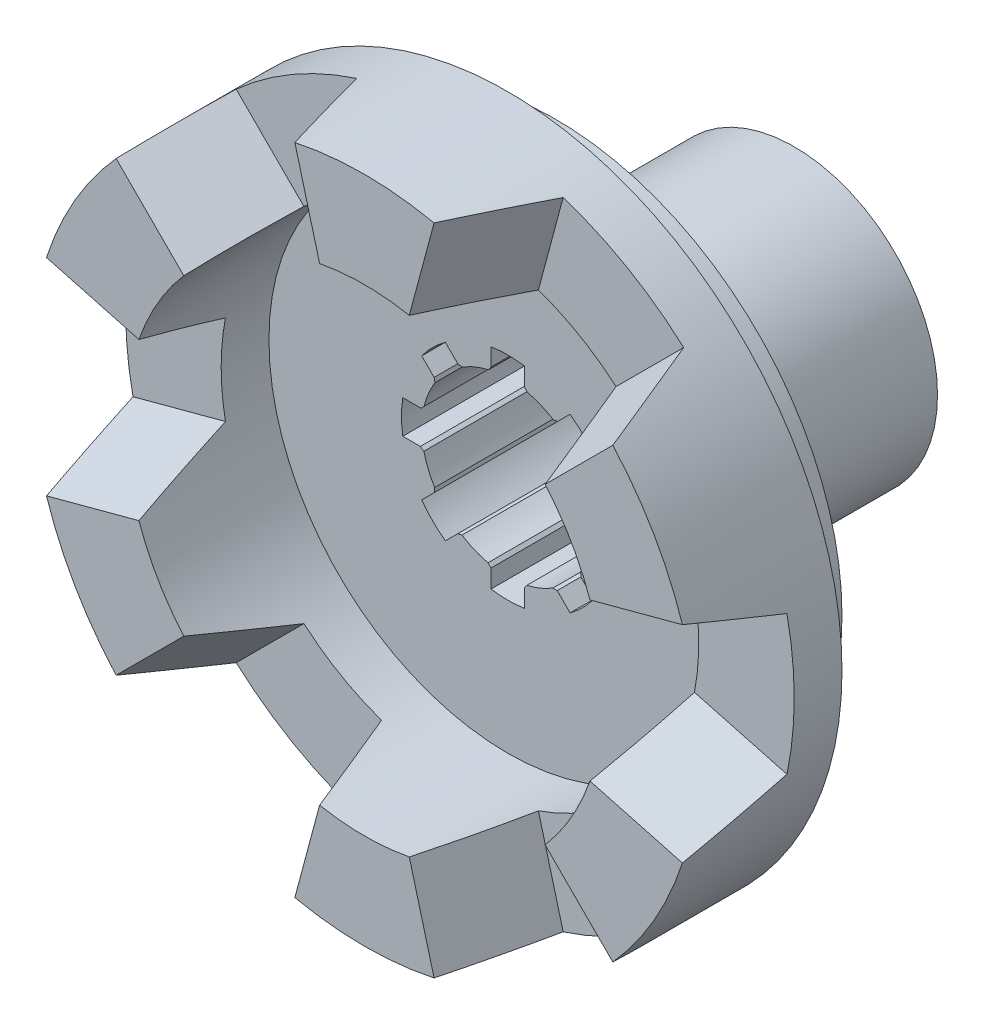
ISO-10303-21;
HEADER;
FILE_DESCRIPTION(('STEP AP214'),'2;1');
FILE_NAME('part.step','',(''),(''),'','','');
FILE_SCHEMA(('AUTOMOTIVE_DESIGN { 1 0 10303 214 1 1 1 1 }'));
ENDSEC;
DATA;
#1=APPLICATION_CONTEXT('core data for automotive mechanical design processes');
#2=APPLICATION_PROTOCOL_DEFINITION('international standard','automotive_design',2000,#1);
#3=PRODUCT_CONTEXT('',#1,'mechanical');
#4=PRODUCT('Part','Part','',(#3));
#5=PRODUCT_RELATED_PRODUCT_CATEGORY('part','',(#4));
#6=PRODUCT_DEFINITION_FORMATION('','',#4);
#7=PRODUCT_DEFINITION_CONTEXT('part definition',#1,'design');
#8=PRODUCT_DEFINITION('design','',#6,#7);
#9=PRODUCT_DEFINITION_SHAPE('','',#8);
#10=(LENGTH_UNIT() NAMED_UNIT(*) SI_UNIT(.MILLI.,.METRE.));
#11=(NAMED_UNIT(*) PLANE_ANGLE_UNIT() SI_UNIT($,.RADIAN.));
#12=(NAMED_UNIT(*) SI_UNIT($,.STERADIAN.) SOLID_ANGLE_UNIT());
#13=UNCERTAINTY_MEASURE_WITH_UNIT(LENGTH_MEASURE(1.E-05),#10,'distance_accuracy_value','');
#14=(GEOMETRIC_REPRESENTATION_CONTEXT(3) GLOBAL_UNCERTAINTY_ASSIGNED_CONTEXT((#13)) GLOBAL_UNIT_ASSIGNED_CONTEXT((#10,
#11,#12)) REPRESENTATION_CONTEXT('',''));
#15=CARTESIAN_POINT('',(0.,0.,0.));
#16=DIRECTION('',(0.,0.,1.));
#17=DIRECTION('',(1.,0.,0.));
#18=AXIS2_PLACEMENT_3D('',#15,#16,#17);
#19=CARTESIAN_POINT('',(0.,0.,0.));
#20=DIRECTION('',(0.,0.,1.));
#21=DIRECTION('',(1.,0.,0.));
#22=AXIS2_PLACEMENT_3D('',#19,#20,#21);
#23=CYLINDRICAL_SURFACE('',#22,18.);
#24=CARTESIAN_POINT('',(0.,0.,-80.));
#25=DIRECTION('',(0.,0.,1.));
#26=DIRECTION('',(1.,0.,0.));
#27=AXIS2_PLACEMENT_3D('',#24,#25,#26);
#28=CIRCLE('',#27,18.);
#29=CARTESIAN_POINT('',(15.2359585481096,-9.58465268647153,-80.));
#30=VERTEX_POINT('',#29);
#31=CARTESIAN_POINT('',(17.5177369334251,-4.13870664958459,-80.));
#32=VERTEX_POINT('',#31);
#33=EDGE_CURVE('E1315',#30,#32,#28,.T.);
#34=ORIENTED_EDGE('',*,*,#33,.F.);
#35=DIRECTION('',(0.,0.,1.));
#36=VECTOR('',#35,1.);
#37=CARTESIAN_POINT('',(15.2359585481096,-9.58465268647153,0.));
#38=LINE('',#37,#36);
#39=CARTESIAN_POINT('',(15.2359585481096,-9.58465268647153,-20.));
#40=VERTEX_POINT('',#39);
#41=EDGE_CURVE('E1099',#30,#40,#38,.T.);
#42=ORIENTED_EDGE('',*,*,#41,.T.);
#43=CARTESIAN_POINT('',(0.,0.,-20.));
#44=DIRECTION('',(0.,0.,1.));
#45=DIRECTION('',(1.,0.,0.));
#46=AXIS2_PLACEMENT_3D('',#43,#44,#45);
#47=CIRCLE('',#46,18.);
#48=CARTESIAN_POINT('',(17.5177369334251,-4.13870664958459,-20.));
#49=VERTEX_POINT('',#48);
#50=EDGE_CURVE('E1258',#40,#49,#47,.T.);
#51=ORIENTED_EDGE('',*,*,#50,.T.);
#52=DIRECTION('',(0.,0.,1.));
#53=VECTOR('',#52,1.);
#54=CARTESIAN_POINT('',(17.5177369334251,-4.13870664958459,0.));
#55=LINE('',#54,#53);
#56=EDGE_CURVE('E1082',#49,#32,#55,.F.);
#57=ORIENTED_EDGE('',*,*,#56,.T.);
#58=EDGE_LOOP('',(#34,#42,#51,#57));
#59=FACE_BOUND('',#58,.T.);
#60=ADVANCED_FACE('F43',(#59),#23,.F.);
#61=CARTESIAN_POINT('',(3.99607669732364,-17.5508225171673,-80.));
#62=VERTEX_POINT('',#61);
#63=CARTESIAN_POINT('',(9.46040303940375,-15.31341811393,-80.));
#64=VERTEX_POINT('',#63);
#65=EDGE_CURVE('E1310',#62,#64,#28,.T.);
#66=ORIENTED_EDGE('',*,*,#65,.F.);
#67=DIRECTION('',(0.,0.,1.));
#68=VECTOR('',#67,1.);
#69=CARTESIAN_POINT('',(3.99607669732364,-17.5508225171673,0.));
#70=LINE('',#69,#68);
#71=CARTESIAN_POINT('',(3.99607669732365,-17.5508225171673,-20.));
#72=VERTEX_POINT('',#71);
#73=EDGE_CURVE('E1126',#62,#72,#70,.T.);
#74=ORIENTED_EDGE('',*,*,#73,.T.);
#75=CARTESIAN_POINT('',(9.46040303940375,-15.31341811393,-20.));
#76=VERTEX_POINT('',#75);
#77=EDGE_CURVE('E1263',#72,#76,#47,.T.);
#78=ORIENTED_EDGE('',*,*,#77,.T.);
#79=DIRECTION('',(0.,0.,1.));
#80=VECTOR('',#79,1.);
#81=CARTESIAN_POINT('',(9.46040303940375,-15.31341811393,0.));
#82=LINE('',#81,#80);
#83=EDGE_CURVE('E1109',#76,#64,#82,.F.);
#84=ORIENTED_EDGE('',*,*,#83,.T.);
#85=EDGE_LOOP('',(#66,#74,#78,#84));
#86=FACE_BOUND('',#85,.T.);
#87=ADVANCED_FACE('F1397',(#86),#23,.F.);
#88=CARTESIAN_POINT('',(-9.58465268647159,-15.2359585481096,-80.));
#89=VERTEX_POINT('',#88);
#90=CARTESIAN_POINT('',(-4.1387066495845,-17.5177369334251,-80.));
#91=VERTEX_POINT('',#90);
#92=EDGE_CURVE('E1306',#89,#91,#28,.T.);
#93=ORIENTED_EDGE('',*,*,#92,.F.);
#94=DIRECTION('',(0.,0.,1.));
#95=VECTOR('',#94,1.);
#96=CARTESIAN_POINT('',(-9.5846526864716,-15.2359585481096,0.));
#97=LINE('',#96,#95);
#98=CARTESIAN_POINT('',(-9.5846526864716,-15.2359585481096,-20.));
#99=VERTEX_POINT('',#98);
#100=EDGE_CURVE('E1153',#89,#99,#97,.T.);
#101=ORIENTED_EDGE('',*,*,#100,.T.);
#102=CARTESIAN_POINT('',(-4.13870664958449,-17.5177369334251,-20.));
#103=VERTEX_POINT('',#102);
#104=EDGE_CURVE('E1268',#99,#103,#47,.T.);
#105=ORIENTED_EDGE('',*,*,#104,.T.);
#106=DIRECTION('',(0.,0.,1.));
#107=VECTOR('',#106,1.);
#108=CARTESIAN_POINT('',(-4.1387066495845,-17.5177369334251,0.));
#109=LINE('',#108,#107);
#110=EDGE_CURVE('E1136',#103,#91,#109,.F.);
#111=ORIENTED_EDGE('',*,*,#110,.T.);
#112=EDGE_LOOP('',(#93,#101,#105,#111));
#113=FACE_BOUND('',#112,.T.);
#114=ADVANCED_FACE('F1460',(#113),#23,.F.);
#115=CARTESIAN_POINT('',(-17.5508225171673,-3.99607669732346,-80.));
#116=VERTEX_POINT('',#115);
#117=CARTESIAN_POINT('',(-15.31341811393,-9.46040303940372,-80.));
#118=VERTEX_POINT('',#117);
#119=EDGE_CURVE('E1301',#116,#118,#28,.T.);
#120=ORIENTED_EDGE('',*,*,#119,.F.);
#121=DIRECTION('',(0.,0.,1.));
#122=VECTOR('',#121,1.);
#123=CARTESIAN_POINT('',(-17.5508225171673,-3.99607669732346,0.));
#124=LINE('',#123,#122);
#125=CARTESIAN_POINT('',(-17.5508225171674,-3.99607669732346,-20.));
#126=VERTEX_POINT('',#125);
#127=EDGE_CURVE('E1178',#116,#126,#124,.T.);
#128=ORIENTED_EDGE('',*,*,#127,.T.);
#129=CARTESIAN_POINT('',(-15.3134181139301,-9.46040303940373,-20.));
#130=VERTEX_POINT('',#129);
#131=EDGE_CURVE('E1273',#126,#130,#47,.T.);
#132=ORIENTED_EDGE('',*,*,#131,.T.);
#133=DIRECTION('',(0.,0.,1.));
#134=VECTOR('',#133,1.);
#135=CARTESIAN_POINT('',(-15.3134181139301,-9.46040303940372,0.));
#136=LINE('',#135,#134);
#137=EDGE_CURVE('E1163',#130,#118,#136,.F.);
#138=ORIENTED_EDGE('',*,*,#137,.T.);
#139=EDGE_LOOP('',(#120,#128,#132,#138));
#140=FACE_BOUND('',#139,.T.);
#141=ADVANCED_FACE('F1303',(#140),#23,.F.);
#142=CARTESIAN_POINT('',(-15.2359585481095,9.58465268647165,-80.));
#143=VERTEX_POINT('',#142);
#144=CARTESIAN_POINT('',(-17.517736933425,4.13870664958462,-80.));
#145=VERTEX_POINT('',#144);
#146=EDGE_CURVE('E758',#143,#145,#28,.T.);
#147=ORIENTED_EDGE('',*,*,#146,.F.);
#148=DIRECTION('',(0.,0.,1.));
#149=VECTOR('',#148,1.);
#150=CARTESIAN_POINT('',(-15.2359585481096,9.58465268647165,0.));
#151=LINE('',#150,#149);
#152=CARTESIAN_POINT('',(-15.2359585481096,9.58465268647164,-20.));
#153=VERTEX_POINT('',#152);
#154=EDGE_CURVE('E1205',#143,#153,#151,.T.);
#155=ORIENTED_EDGE('',*,*,#154,.T.);
#156=CARTESIAN_POINT('',(-17.5177369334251,4.13870664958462,-20.));
#157=VERTEX_POINT('',#156);
#158=EDGE_CURVE('E763',#153,#157,#47,.T.);
#159=ORIENTED_EDGE('',*,*,#158,.T.);
#160=DIRECTION('',(0.,0.,1.));
#161=VECTOR('',#160,1.);
#162=CARTESIAN_POINT('',(-17.517736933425,4.13870664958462,0.));
#163=LINE('',#162,#161);
#164=EDGE_CURVE('E1188',#157,#145,#163,.F.);
#165=ORIENTED_EDGE('',*,*,#164,.T.);
#166=EDGE_LOOP('',(#147,#155,#159,#165));
#167=FACE_BOUND('',#166,.T.);
#168=ADVANCED_FACE('F1285',(#167),#23,.F.);
#169=CARTESIAN_POINT('',(-3.99607669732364,17.5508225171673,-20.));
#170=VERTEX_POINT('',#169);
#171=CARTESIAN_POINT('',(-9.46040303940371,15.3134181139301,-20.));
#172=VERTEX_POINT('',#171);
#173=EDGE_CURVE('E759',#170,#172,#47,.T.);
#174=ORIENTED_EDGE('',*,*,#173,.T.);
#175=DIRECTION('',(0.,0.,1.));
#176=VECTOR('',#175,1.);
#177=CARTESIAN_POINT('',(-9.46040303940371,15.3134181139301,0.));
#178=LINE('',#177,#176);
#179=CARTESIAN_POINT('',(-9.46040303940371,15.3134181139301,-80.));
#180=VERTEX_POINT('',#179);
#181=EDGE_CURVE('E53',#172,#180,#178,.F.);
#182=ORIENTED_EDGE('',*,*,#181,.T.);
#183=CARTESIAN_POINT('',(-3.99607669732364,17.5508225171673,-80.));
#184=VERTEX_POINT('',#183);
#185=EDGE_CURVE('E753',#184,#180,#28,.T.);
#186=ORIENTED_EDGE('',*,*,#185,.F.);
#187=DIRECTION('',(0.,0.,1.));
#188=VECTOR('',#187,1.);
#189=CARTESIAN_POINT('',(-3.99607669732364,17.5508225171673,0.));
#190=LINE('',#189,#188);
#191=EDGE_CURVE('E1022',#184,#170,#190,.T.);
#192=ORIENTED_EDGE('',*,*,#191,.T.);
#193=EDGE_LOOP('',(#174,#182,#186,#192));
#194=FACE_BOUND('',#193,.T.);
#195=ADVANCED_FACE('F1218',(#194),#23,.F.);
#196=CARTESIAN_POINT('',(17.5508225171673,3.99607669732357,-80.));
#197=VERTEX_POINT('',#196);
#198=CARTESIAN_POINT('',(15.31341811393,9.46040303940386,-80.));
#199=VERTEX_POINT('',#198);
#200=EDGE_CURVE('E1320',#197,#199,#28,.T.);
#201=ORIENTED_EDGE('',*,*,#200,.F.);
#202=DIRECTION('',(0.,0.,1.));
#203=VECTOR('',#202,1.);
#204=CARTESIAN_POINT('',(17.5508225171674,3.99607669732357,0.));
#205=LINE('',#204,#203);
#206=CARTESIAN_POINT('',(17.5508225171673,3.99607669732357,-20.));
#207=VERTEX_POINT('',#206);
#208=EDGE_CURVE('E1072',#197,#207,#205,.T.);
#209=ORIENTED_EDGE('',*,*,#208,.T.);
#210=CARTESIAN_POINT('',(15.31341811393,9.46040303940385,-20.));
#211=VERTEX_POINT('',#210);
#212=EDGE_CURVE('E1255',#207,#211,#47,.T.);
#213=ORIENTED_EDGE('',*,*,#212,.T.);
#214=DIRECTION('',(0.,0.,1.));
#215=VECTOR('',#214,1.);
#216=CARTESIAN_POINT('',(15.31341811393,9.46040303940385,0.));
#217=LINE('',#216,#215);
#218=EDGE_CURVE('E1055',#211,#199,#217,.F.);
#219=ORIENTED_EDGE('',*,*,#218,.T.);
#220=EDGE_LOOP('',(#201,#209,#213,#219));
#221=FACE_BOUND('',#220,.T.);
#222=ADVANCED_FACE('F1351',(#221),#23,.F.);
#223=CARTESIAN_POINT('',(0.,0.,-10.));
#224=DIRECTION('',(0.,0.,-1.));
#225=DIRECTION('',(-1.,0.,0.));
#226=AXIS2_PLACEMENT_3D('',#223,#224,#225);
#227=PLANE('',#226);
#228=DIRECTION('',(0.707106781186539,0.707106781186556,0.));
#229=VECTOR('',#228,1.);
#230=CARTESIAN_POINT('',(-2.57365820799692,2.57365820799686,-10.));
#231=LINE('',#230,#229);
#232=CARTESIAN_POINT('',(46.8568615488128,52.0041779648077,-10.));
#233=VERTEX_POINT('',#232);
#234=CARTESIAN_POINT('',(32.6878829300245,37.8351993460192,-9.99999999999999));
#235=VERTEX_POINT('',#234);
#236=EDGE_CURVE('E771',#233,#235,#231,.F.);
#237=ORIENTED_EDGE('',*,*,#236,.F.);
#238=CARTESIAN_POINT('',(0.,0.,-10.));
#239=DIRECTION('',(0.,0.,-1.));
#240=DIRECTION('',(-1.,0.,0.));
#241=AXIS2_PLACEMENT_3D('',#238,#239,#240);
#242=CIRCLE('',#241,70.);
#243=CARTESIAN_POINT('',(21.6085084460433,66.5813214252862,-9.99999999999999));
#244=VERTEX_POINT('',#243);
#245=EDGE_CURVE('E967',#244,#233,#242,.T.);
#246=ORIENTED_EDGE('',*,*,#245,.F.);
#247=DIRECTION('',(-0.258819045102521,-0.965925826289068,0.));
#248=VECTOR('',#247,1.);
#249=CARTESIAN_POINT('',(3.51568249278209,-0.942024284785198,-10.));
#250=LINE('',#249,#248);
#251=CARTESIAN_POINT('',(16.4223023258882,47.2261366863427,-9.99999999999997));
#252=VERTEX_POINT('',#251);
#253=EDGE_CURVE('E977',#252,#244,#250,.F.);
#254=ORIENTED_EDGE('',*,*,#253,.F.);
#255=CARTESIAN_POINT('',(0.,0.,-10.));
#256=DIRECTION('',(0.,0.,-1.));
#257=DIRECTION('',(-1.,0.,0.));
#258=AXIS2_PLACEMENT_3D('',#255,#256,#257);
#259=CIRCLE('',#258,50.);
#260=EDGE_CURVE('E957',#252,#235,#259,.T.);
#261=ORIENTED_EDGE('',*,*,#260,.T.);
#262=EDGE_LOOP('',(#237,#246,#254,#261));
#263=FACE_BOUND('',#262,.T.);
#264=ADVANCED_FACE('F1475',(#263),#227,.F.);
#265=DIRECTION('',(-0.965925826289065,-0.258819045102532,0.));
#266=VECTOR('',#265,1.);
#267=CARTESIAN_POINT('',(0.942024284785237,-3.51568249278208,-10.));
#268=LINE('',#267,#266);
#269=CARTESIAN_POINT('',(49.110185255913,9.39093734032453,-9.99999999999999));
#270=VERTEX_POINT('',#269);
#271=CARTESIAN_POINT('',(68.4653699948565,14.5771434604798,-10.));
#272=VERTEX_POINT('',#271);
#273=EDGE_CURVE('E777',#270,#272,#268,.F.);
#274=ORIENTED_EDGE('',*,*,#273,.F.);
#275=CARTESIAN_POINT('',(49.1101852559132,-9.39093734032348,-9.99999999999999));
#276=VERTEX_POINT('',#275);
#277=EDGE_CURVE('E961',#270,#276,#259,.T.);
#278=ORIENTED_EDGE('',*,*,#277,.T.);
#279=DIRECTION('',(0.965925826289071,-0.258819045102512,0.));
#280=VECTOR('',#279,1.);
#281=CARTESIAN_POINT('',(0.942024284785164,3.5156824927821,-10.));
#282=LINE('',#281,#280);
#283=CARTESIAN_POINT('',(68.4653699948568,-14.5771434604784,-10.));
#284=VERTEX_POINT('',#283);
#285=EDGE_CURVE('E789',#284,#276,#282,.F.);
#286=ORIENTED_EDGE('',*,*,#285,.F.);
#287=EDGE_CURVE('E971',#272,#284,#242,.T.);
#288=ORIENTED_EDGE('',*,*,#287,.F.);
#289=EDGE_LOOP('',(#274,#278,#286,#288));
#290=FACE_BOUND('',#289,.T.);
#291=ADVANCED_FACE('F1481',(#290),#227,.F.);
#292=DIRECTION('',(-0.707106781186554,0.707106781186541,0.));
#293=VECTOR('',#292,1.);
#294=CARTESIAN_POINT('',(-2.57365820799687,-2.57365820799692,-10.));
#295=LINE('',#294,#293);
#296=CARTESIAN_POINT('',(32.6878829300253,-37.8351993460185,-10.));
#297=VERTEX_POINT('',#296);
#298=CARTESIAN_POINT('',(46.8568615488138,-52.0041779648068,-10.));
#299=VERTEX_POINT('',#298);
#300=EDGE_CURVE('E814',#297,#299,#295,.F.);
#301=ORIENTED_EDGE('',*,*,#300,.F.);
#302=CARTESIAN_POINT('',(16.4223023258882,-47.2261366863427,-10.));
#303=VERTEX_POINT('',#302);
#304=EDGE_CURVE('E2073',#297,#303,#259,.T.);
#305=ORIENTED_EDGE('',*,*,#304,.T.);
#306=DIRECTION('',(0.258819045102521,-0.965925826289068,0.));
#307=VECTOR('',#306,1.);
#308=CARTESIAN_POINT('',(3.51568249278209,0.9420242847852,-10.));
#309=LINE('',#308,#307);
#310=CARTESIAN_POINT('',(21.6085084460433,-66.5813214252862,-10.));
#311=VERTEX_POINT('',#310);
#312=EDGE_CURVE('E826',#311,#303,#309,.F.);
#313=ORIENTED_EDGE('',*,*,#312,.F.);
#314=EDGE_CURVE('E2113',#299,#311,#242,.T.);
#315=ORIENTED_EDGE('',*,*,#314,.F.);
#316=EDGE_LOOP('',(#301,#305,#313,#315));
#317=FACE_BOUND('',#316,.T.);
#318=ADVANCED_FACE('F1942',(#317),#227,.F.);
#319=DIRECTION('',(0.258819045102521,0.965925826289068,0.));
#320=VECTOR('',#319,1.);
#321=CARTESIAN_POINT('',(-3.51568249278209,0.9420242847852,-10.));
#322=LINE('',#321,#320);
#323=CARTESIAN_POINT('',(-16.4223023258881,-47.2261366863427,-10.));
#324=VERTEX_POINT('',#323);
#325=CARTESIAN_POINT('',(-21.6085084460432,-66.5813214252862,-10.));
#326=VERTEX_POINT('',#325);
#327=EDGE_CURVE('E851',#324,#326,#322,.F.);
#328=ORIENTED_EDGE('',*,*,#327,.F.);
#329=CARTESIAN_POINT('',(-32.6878829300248,-37.8351993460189,-10.));
#330=VERTEX_POINT('',#329);
#331=EDGE_CURVE('E2076',#324,#330,#259,.T.);
#332=ORIENTED_EDGE('',*,*,#331,.T.);
#333=DIRECTION('',(-0.707106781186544,-0.707106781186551,0.));
#334=VECTOR('',#333,1.);
#335=CARTESIAN_POINT('',(2.57365820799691,-2.57365820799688,-10.));
#336=LINE('',#335,#334);
#337=CARTESIAN_POINT('',(-46.8568615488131,-52.0041779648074,-10.));
#338=VERTEX_POINT('',#337);
#339=EDGE_CURVE('E863',#338,#330,#336,.F.);
#340=ORIENTED_EDGE('',*,*,#339,.F.);
#341=EDGE_CURVE('E2109',#326,#338,#242,.T.);
#342=ORIENTED_EDGE('',*,*,#341,.F.);
#343=EDGE_LOOP('',(#328,#332,#340,#342));
#344=FACE_BOUND('',#343,.T.);
#345=ADVANCED_FACE('F1935',(#344),#227,.F.);
#346=DIRECTION('',(0.965925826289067,0.258819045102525,0.));
#347=VECTOR('',#346,1.);
#348=CARTESIAN_POINT('',(-0.942024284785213,3.51568249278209,-10.));
#349=LINE('',#348,#347);
#350=CARTESIAN_POINT('',(-49.1101852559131,-9.39093734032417,-10.));
#351=VERTEX_POINT('',#350);
#352=CARTESIAN_POINT('',(-68.4653699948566,-14.5771434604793,-9.99999999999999));
#353=VERTEX_POINT('',#352);
#354=EDGE_CURVE('E888',#351,#353,#349,.F.);
#355=ORIENTED_EDGE('',*,*,#354,.F.);
#356=CARTESIAN_POINT('',(-49.1101852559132,9.39093734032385,-10.));
#357=VERTEX_POINT('',#356);
#358=EDGE_CURVE('E2081',#351,#357,#259,.T.);
#359=ORIENTED_EDGE('',*,*,#358,.T.);
#360=DIRECTION('',(-0.965925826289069,0.258819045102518,0.));
#361=VECTOR('',#360,1.);
#362=CARTESIAN_POINT('',(-0.942024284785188,-3.51568249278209,-10.));
#363=LINE('',#362,#361);
#364=CARTESIAN_POINT('',(-68.4653699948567,14.5771434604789,-10.));
#365=VERTEX_POINT('',#364);
#366=EDGE_CURVE('E900',#365,#357,#363,.F.);
#367=ORIENTED_EDGE('',*,*,#366,.F.);
#368=EDGE_CURVE('E2106',#353,#365,#242,.T.);
#369=ORIENTED_EDGE('',*,*,#368,.F.);
#370=EDGE_LOOP('',(#355,#359,#367,#369));
#371=FACE_BOUND('',#370,.T.);
#372=ADVANCED_FACE('F1928',(#371),#227,.F.);
#373=DIRECTION('',(0.707106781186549,-0.707106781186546,0.));
#374=VECTOR('',#373,1.);
#375=CARTESIAN_POINT('',(2.57365820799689,2.5736582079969,-10.));
#376=LINE('',#375,#374);
#377=CARTESIAN_POINT('',(-32.6878829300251,37.8351993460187,-9.99999999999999));
#378=VERTEX_POINT('',#377);
#379=CARTESIAN_POINT('',(-46.8568615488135,52.0041779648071,-9.99999999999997));
#380=VERTEX_POINT('',#379);
#381=EDGE_CURVE('E925',#378,#380,#376,.F.);
#382=ORIENTED_EDGE('',*,*,#381,.F.);
#383=CARTESIAN_POINT('',(-16.4223023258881,47.2261366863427,-10.));
#384=VERTEX_POINT('',#383);
#385=EDGE_CURVE('E937',#378,#384,#259,.T.);
#386=ORIENTED_EDGE('',*,*,#385,.T.);
#387=DIRECTION('',(-0.258819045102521,0.965925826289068,0.));
#388=VECTOR('',#387,1.);
#389=CARTESIAN_POINT('',(-3.51568249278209,-0.942024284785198,-10.));
#390=LINE('',#389,#388);
#391=CARTESIAN_POINT('',(-21.6085084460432,66.5813214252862,-10.));
#392=VERTEX_POINT('',#391);
#393=EDGE_CURVE('E966',#392,#384,#390,.F.);
#394=ORIENTED_EDGE('',*,*,#393,.F.);
#395=EDGE_CURVE('E960',#380,#392,#242,.T.);
#396=ORIENTED_EDGE('',*,*,#395,.F.);
#397=EDGE_LOOP('',(#382,#386,#394,#396));
#398=FACE_BOUND('',#397,.T.);
#399=ADVANCED_FACE('F1484',(#398),#227,.F.);
#400=CARTESIAN_POINT('',(0.,0.,10.));
#401=DIRECTION('',(0.,0.,-1.));
#402=DIRECTION('',(-1.,0.,0.));
#403=AXIS2_PLACEMENT_3D('',#400,#401,#402);
#404=CYLINDRICAL_SURFACE('',#403,70.);
#405=CARTESIAN_POINT('',(0.,0.,0.));
#406=DIRECTION('',(0.907673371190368,-0.243210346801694,0.342020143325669));
#407=DIRECTION('',(0.330366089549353,-0.0885213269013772,-0.939692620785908));
#408=AXIS2_PLACEMENT_3D('',#405,#406,#407);
#409=ELLIPSE('',#408,204.666308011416,70.);
#410=CARTESIAN_POINT('',(14.5771434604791,68.4653699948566,10.));
#411=VERTEX_POINT('',#410);
#412=EDGE_CURVE('E1003',#411,#244,#409,.F.);
#413=ORIENTED_EDGE('',*,*,#412,.T.);
#414=ORIENTED_EDGE('',*,*,#245,.T.);
#415=CARTESIAN_POINT('',(0.,0.,0.));
#416=DIRECTION('',(-0.664463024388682,0.664463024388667,0.34202014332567));
#417=DIRECTION('',(-0.241844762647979,0.241844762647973,-0.939692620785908));
#418=AXIS2_PLACEMENT_3D('',#415,#416,#417);
#419=ELLIPSE('',#418,204.666308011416,70.);
#420=CARTESIAN_POINT('',(52.0041779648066,46.856861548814,10.));
#421=VERTEX_POINT('',#420);
#422=EDGE_CURVE('E785',#421,#233,#419,.T.);
#423=ORIENTED_EDGE('',*,*,#422,.F.);
#424=CARTESIAN_POINT('',(0.,0.,10.));
#425=DIRECTION('',(0.,0.,1.));
#426=DIRECTION('',(0.50000000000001,-0.866025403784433,0.));
#427=AXIS2_PLACEMENT_3D('',#424,#425,#426);
#428=CIRCLE('',#427,70.);
#429=CARTESIAN_POINT('',(66.581321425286,21.608508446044,10.));
#430=VERTEX_POINT('',#429);
#431=EDGE_CURVE('E772',#430,#421,#428,.T.);
#432=ORIENTED_EDGE('',*,*,#431,.F.);
#433=CARTESIAN_POINT('',(0.,0.,0.));
#434=DIRECTION('',(0.243210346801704,-0.907673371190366,0.342020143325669));
#435=DIRECTION('',(0.0885213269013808,-0.330366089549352,-0.939692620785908));
#436=AXIS2_PLACEMENT_3D('',#433,#434,#435);
#437=ELLIPSE('',#436,204.666308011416,70.);
#438=EDGE_CURVE('E803',#430,#272,#437,.F.);
#439=ORIENTED_EDGE('',*,*,#438,.T.);
#440=ORIENTED_EDGE('',*,*,#287,.T.);
#441=CARTESIAN_POINT('',(0.,0.,0.));
#442=DIRECTION('',(0.243210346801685,0.907673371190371,0.342020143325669));
#443=DIRECTION('',(0.0885213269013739,0.330366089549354,-0.939692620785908));
#444=AXIS2_PLACEMENT_3D('',#441,#442,#443);
#445=ELLIPSE('',#444,204.666308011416,70.);
#446=CARTESIAN_POINT('',(66.5813214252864,-21.6085084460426,9.99999999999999));
#447=VERTEX_POINT('',#446);
#448=EDGE_CURVE('E822',#447,#284,#445,.T.);
#449=ORIENTED_EDGE('',*,*,#448,.F.);
#450=CARTESIAN_POINT('',(0.,0.,10.));
#451=DIRECTION('',(0.,0.,1.));
#452=DIRECTION('',(-0.499999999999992,-0.866025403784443,0.));
#453=AXIS2_PLACEMENT_3D('',#450,#451,#452);
#454=CIRCLE('',#453,70.);
#455=CARTESIAN_POINT('',(52.0041779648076,-46.8568615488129,10.));
#456=VERTEX_POINT('',#455);
#457=EDGE_CURVE('E809',#456,#447,#454,.T.);
#458=ORIENTED_EDGE('',*,*,#457,.F.);
#459=CARTESIAN_POINT('',(0.,0.,0.));
#460=DIRECTION('',(-0.664463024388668,-0.66446302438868,0.342020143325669));
#461=DIRECTION('',(-0.241844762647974,-0.241844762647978,-0.939692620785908));
#462=AXIS2_PLACEMENT_3D('',#459,#460,#461);
#463=ELLIPSE('',#462,204.666308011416,70.);
#464=EDGE_CURVE('E840',#456,#299,#463,.F.);
#465=ORIENTED_EDGE('',*,*,#464,.T.);
#466=ORIENTED_EDGE('',*,*,#314,.T.);
#467=CARTESIAN_POINT('',(0.,0.,0.));
#468=DIRECTION('',(0.907673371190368,0.243210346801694,0.342020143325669));
#469=DIRECTION('',(0.330366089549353,0.0885213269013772,-0.939692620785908));
#470=AXIS2_PLACEMENT_3D('',#467,#468,#469);
#471=ELLIPSE('',#470,204.666308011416,70.);
#472=CARTESIAN_POINT('',(14.5771434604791,-68.4653699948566,10.));
#473=VERTEX_POINT('',#472);
#474=EDGE_CURVE('E859',#473,#311,#471,.T.);
#475=ORIENTED_EDGE('',*,*,#474,.F.);
#476=CARTESIAN_POINT('',(0.,0.,10.));
#477=DIRECTION('',(0.,0.,1.));
#478=DIRECTION('',(-1.,0.,0.));
#479=AXIS2_PLACEMENT_3D('',#476,#477,#478);
#480=CIRCLE('',#479,70.);
#481=CARTESIAN_POINT('',(-14.5771434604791,-68.4653699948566,10.));
#482=VERTEX_POINT('',#481);
#483=EDGE_CURVE('E846',#482,#473,#480,.T.);
#484=ORIENTED_EDGE('',*,*,#483,.F.);
#485=CARTESIAN_POINT('',(0.,0.,0.));
#486=DIRECTION('',(-0.907673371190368,0.243210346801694,0.342020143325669));
#487=DIRECTION('',(-0.330366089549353,0.0885213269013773,-0.939692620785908));
#488=AXIS2_PLACEMENT_3D('',#485,#486,#487);
#489=ELLIPSE('',#488,204.666308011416,70.);
#490=EDGE_CURVE('E877',#482,#326,#489,.F.);
#491=ORIENTED_EDGE('',*,*,#490,.T.);
#492=ORIENTED_EDGE('',*,*,#341,.T.);
#493=CARTESIAN_POINT('',(0.,0.,0.));
#494=DIRECTION('',(0.664463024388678,-0.664463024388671,0.342020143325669));
#495=DIRECTION('',(0.241844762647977,-0.241844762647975,-0.939692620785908));
#496=AXIS2_PLACEMENT_3D('',#493,#494,#495);
#497=ELLIPSE('',#496,204.666308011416,70.);
#498=CARTESIAN_POINT('',(-52.0041779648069,-46.8568615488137,10.));
#499=VERTEX_POINT('',#498);
#500=EDGE_CURVE('E896',#499,#338,#497,.T.);
#501=ORIENTED_EDGE('',*,*,#500,.F.);
#502=CARTESIAN_POINT('',(0.,0.,10.));
#503=DIRECTION('',(0.,0.,1.));
#504=DIRECTION('',(-0.500000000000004,0.866025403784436,0.));
#505=AXIS2_PLACEMENT_3D('',#502,#503,#504);
#506=CIRCLE('',#505,70.);
#507=CARTESIAN_POINT('',(-66.5813214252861,-21.6085084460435,10.));
#508=VERTEX_POINT('',#507);
#509=EDGE_CURVE('E883',#508,#499,#506,.T.);
#510=ORIENTED_EDGE('',*,*,#509,.F.);
#511=CARTESIAN_POINT('',(0.,0.,0.));
#512=DIRECTION('',(-0.243210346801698,0.907673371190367,0.34202014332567));
#513=DIRECTION('',(-0.0885213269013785,0.330366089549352,-0.939692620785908));
#514=AXIS2_PLACEMENT_3D('',#511,#512,#513);
#515=ELLIPSE('',#514,204.666308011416,70.);
#516=EDGE_CURVE('E914',#508,#353,#515,.F.);
#517=ORIENTED_EDGE('',*,*,#516,.T.);
#518=ORIENTED_EDGE('',*,*,#368,.T.);
#519=CARTESIAN_POINT('',(0.,0.,0.));
#520=DIRECTION('',(-0.243210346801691,-0.90767337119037,0.342020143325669));
#521=DIRECTION('',(-0.0885213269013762,-0.330366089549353,-0.939692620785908));
#522=AXIS2_PLACEMENT_3D('',#519,#520,#521);
#523=ELLIPSE('',#522,204.666308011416,70.);
#524=CARTESIAN_POINT('',(-66.5813214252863,21.608508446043,10.));
#525=VERTEX_POINT('',#524);
#526=EDGE_CURVE('E933',#525,#365,#523,.T.);
#527=ORIENTED_EDGE('',*,*,#526,.F.);
#528=CARTESIAN_POINT('',(0.,0.,10.));
#529=DIRECTION('',(0.,0.,1.));
#530=DIRECTION('',(0.499999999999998,0.86602540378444,0.));
#531=AXIS2_PLACEMENT_3D('',#528,#529,#530);
#532=CIRCLE('',#531,70.);
#533=CARTESIAN_POINT('',(-52.0041779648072,46.8568615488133,10.));
#534=VERTEX_POINT('',#533);
#535=EDGE_CURVE('E920',#534,#525,#532,.T.);
#536=ORIENTED_EDGE('',*,*,#535,.F.);
#537=CARTESIAN_POINT('',(0.,0.,0.));
#538=DIRECTION('',(0.664463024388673,0.664463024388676,0.342020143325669));
#539=DIRECTION('',(0.241844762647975,0.241844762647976,-0.939692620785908));
#540=AXIS2_PLACEMENT_3D('',#537,#538,#539);
#541=ELLIPSE('',#540,204.666308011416,70.);
#542=EDGE_CURVE('E951',#534,#380,#541,.F.);
#543=ORIENTED_EDGE('',*,*,#542,.T.);
#544=ORIENTED_EDGE('',*,*,#395,.T.);
#545=CARTESIAN_POINT('',(0.,0.,0.));
#546=DIRECTION('',(-0.907673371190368,-0.243210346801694,0.342020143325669));
#547=DIRECTION('',(-0.330366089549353,-0.0885213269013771,-0.939692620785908));
#548=AXIS2_PLACEMENT_3D('',#545,#546,#547);
#549=ELLIPSE('',#548,204.666308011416,70.);
#550=CARTESIAN_POINT('',(-14.5771434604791,68.4653699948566,10.));
#551=VERTEX_POINT('',#550);
#552=EDGE_CURVE('E985',#551,#392,#549,.T.);
#553=ORIENTED_EDGE('',*,*,#552,.F.);
#554=CARTESIAN_POINT('',(0.,0.,10.));
#555=DIRECTION('',(0.,0.,1.));
#556=DIRECTION('',(1.,0.,0.));
#557=AXIS2_PLACEMENT_3D('',#554,#555,#556);
#558=CIRCLE('',#557,70.);
#559=EDGE_CURVE('E972',#411,#551,#558,.T.);
#560=ORIENTED_EDGE('',*,*,#559,.F.);
#561=EDGE_LOOP('',(#413,#414,#423,#432,#439,#440,#449,#458,#465,#466,#475,#484,#491,#492,#501,
#510,#517,#518,#527,#536,#543,#544,#553,#560));
#562=FACE_BOUND('',#561,.T.);
#563=CARTESIAN_POINT('',(0.,0.,-20.));
#564=DIRECTION('',(0.,0.,-1.));
#565=DIRECTION('',(-1.,0.,0.));
#566=AXIS2_PLACEMENT_3D('',#563,#564,#565);
#567=CIRCLE('',#566,70.);
#568=CARTESIAN_POINT('',(-70.,0.,-20.));
#569=VERTEX_POINT('',#568);
#570=EDGE_CURVE('E962',#569,#569,#567,.T.);
#571=ORIENTED_EDGE('',*,*,#570,.F.);
#572=EDGE_LOOP('',(#571));
#573=FACE_BOUND('',#572,.T.);
#574=ADVANCED_FACE('F1770',(#562,#573),#404,.T.);
#575=CARTESIAN_POINT('',(0.,0.,0.));
#576=DIRECTION('',(-0.907673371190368,-0.243210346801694,0.342020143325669));
#577=DIRECTION('',(0.352607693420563,0.,0.935771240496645));
#578=AXIS2_PLACEMENT_3D('',#575,#576,#577);
#579=PLANE('',#578);
#580=ORIENTED_EDGE('',*,*,#393,.T.);
#581=CARTESIAN_POINT('',(0.,0.,0.));
#582=DIRECTION('',(-0.907673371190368,-0.243210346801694,0.342020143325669));
#583=DIRECTION('',(-0.330366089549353,-0.0885213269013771,-0.939692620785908));
#584=AXIS2_PLACEMENT_3D('',#581,#582,#583);
#585=ELLIPSE('',#584,146.190220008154,50.);
#586=CARTESIAN_POINT('',(-9.390937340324,49.1101852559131,9.99999999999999));
#587=VERTEX_POINT('',#586);
#588=EDGE_CURVE('E990',#587,#384,#585,.T.);
#589=ORIENTED_EDGE('',*,*,#588,.F.);
#590=DIRECTION('',(-0.258819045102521,0.965925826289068,0.));
#591=VECTOR('',#590,1.);
#592=CARTESIAN_POINT('',(3.51568249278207,0.942024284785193,10.));
#593=LINE('',#592,#591);
#594=EDGE_CURVE('E976',#551,#587,#593,.F.);
#595=ORIENTED_EDGE('',*,*,#594,.F.);
#596=ORIENTED_EDGE('',*,*,#552,.T.);
#597=EDGE_LOOP('',(#580,#589,#595,#596));
#598=FACE_BOUND('',#597,.T.);
#599=ADVANCED_FACE('F1767',(#598),#579,.T.);
#600=CARTESIAN_POINT('',(0.,0.,10.));
#601=DIRECTION('',(0.,0.,-1.));
#602=DIRECTION('',(-1.,0.,0.));
#603=AXIS2_PLACEMENT_3D('',#600,#601,#602);
#604=CYLINDRICAL_SURFACE('',#603,50.);
#605=ORIENTED_EDGE('',*,*,#588,.T.);
#606=ORIENTED_EDGE('',*,*,#385,.F.);
#607=CARTESIAN_POINT('',(0.,0.,0.));
#608=DIRECTION('',(0.664463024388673,0.664463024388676,0.342020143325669));
#609=DIRECTION('',(0.241844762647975,0.241844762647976,-0.939692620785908));
#610=AXIS2_PLACEMENT_3D('',#607,#608,#609);
#611=ELLIPSE('',#610,146.190220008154,50.);
#612=CARTESIAN_POINT('',(-37.8351993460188,32.6878829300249,10.));
#613=VERTEX_POINT('',#612);
#614=EDGE_CURVE('E944',#613,#378,#611,.F.);
#615=ORIENTED_EDGE('',*,*,#614,.F.);
#616=CARTESIAN_POINT('',(0.,0.,10.));
#617=DIRECTION('',(0.,0.,-1.));
#618=DIRECTION('',(0.499999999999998,0.86602540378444,0.));
#619=AXIS2_PLACEMENT_3D('',#616,#617,#618);
#620=CIRCLE('',#619,50.);
#621=CARTESIAN_POINT('',(-47.2261366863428,16.422302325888,10.));
#622=VERTEX_POINT('',#621);
#623=EDGE_CURVE('E926',#622,#613,#620,.T.);
#624=ORIENTED_EDGE('',*,*,#623,.F.);
#625=CARTESIAN_POINT('',(0.,0.,0.));
#626=DIRECTION('',(-0.243210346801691,-0.90767337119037,0.342020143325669));
#627=DIRECTION('',(-0.0885213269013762,-0.330366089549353,-0.939692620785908));
#628=AXIS2_PLACEMENT_3D('',#625,#626,#627);
#629=ELLIPSE('',#628,146.190220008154,50.);
#630=EDGE_CURVE('E938',#622,#357,#629,.T.);
#631=ORIENTED_EDGE('',*,*,#630,.T.);
#632=ORIENTED_EDGE('',*,*,#358,.F.);
#633=CARTESIAN_POINT('',(0.,0.,0.));
#634=DIRECTION('',(-0.243210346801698,0.907673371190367,0.34202014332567));
#635=DIRECTION('',(-0.0885213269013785,0.330366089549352,-0.939692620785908));
#636=AXIS2_PLACEMENT_3D('',#633,#634,#635);
#637=ELLIPSE('',#636,146.190220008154,50.);
#638=CARTESIAN_POINT('',(-47.2261366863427,-16.4223023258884,10.));
#639=VERTEX_POINT('',#638);
#640=EDGE_CURVE('E907',#639,#351,#637,.F.);
#641=ORIENTED_EDGE('',*,*,#640,.F.);
#642=CARTESIAN_POINT('',(0.,0.,10.));
#643=DIRECTION('',(0.,0.,-1.));
#644=DIRECTION('',(-0.500000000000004,0.866025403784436,0.));
#645=AXIS2_PLACEMENT_3D('',#642,#643,#644);
#646=CIRCLE('',#645,50.);
#647=CARTESIAN_POINT('',(-37.8351993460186,-32.6878829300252,10.));
#648=VERTEX_POINT('',#647);
#649=EDGE_CURVE('E889',#648,#639,#646,.T.);
#650=ORIENTED_EDGE('',*,*,#649,.F.);
#651=CARTESIAN_POINT('',(0.,0.,0.));
#652=DIRECTION('',(0.664463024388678,-0.664463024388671,0.342020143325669));
#653=DIRECTION('',(0.241844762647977,-0.241844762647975,-0.939692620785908));
#654=AXIS2_PLACEMENT_3D('',#651,#652,#653);
#655=ELLIPSE('',#654,146.190220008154,50.);
#656=EDGE_CURVE('E901',#648,#330,#655,.T.);
#657=ORIENTED_EDGE('',*,*,#656,.T.);
#658=ORIENTED_EDGE('',*,*,#331,.F.);
#659=CARTESIAN_POINT('',(0.,0.,0.));
#660=DIRECTION('',(-0.907673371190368,0.243210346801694,0.342020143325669));
#661=DIRECTION('',(-0.330366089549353,0.0885213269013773,-0.939692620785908));
#662=AXIS2_PLACEMENT_3D('',#659,#660,#661);
#663=ELLIPSE('',#662,146.190220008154,50.);
#664=CARTESIAN_POINT('',(-9.390937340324,-49.1101852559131,10.));
#665=VERTEX_POINT('',#664);
#666=EDGE_CURVE('E870',#665,#324,#663,.F.);
#667=ORIENTED_EDGE('',*,*,#666,.F.);
#668=CARTESIAN_POINT('',(0.,0.,10.));
#669=DIRECTION('',(0.,0.,-1.));
#670=DIRECTION('',(-1.,0.,0.));
#671=AXIS2_PLACEMENT_3D('',#668,#669,#670);
#672=CIRCLE('',#671,50.);
#673=CARTESIAN_POINT('',(9.390937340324,-49.1101852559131,10.));
#674=VERTEX_POINT('',#673);
#675=EDGE_CURVE('E852',#674,#665,#672,.T.);
#676=ORIENTED_EDGE('',*,*,#675,.F.);
#677=CARTESIAN_POINT('',(0.,0.,0.));
#678=DIRECTION('',(0.907673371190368,0.243210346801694,0.342020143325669));
#679=DIRECTION('',(0.330366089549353,0.0885213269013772,-0.939692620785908));
#680=AXIS2_PLACEMENT_3D('',#677,#678,#679);
#681=ELLIPSE('',#680,146.190220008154,50.);
#682=EDGE_CURVE('E864',#674,#303,#681,.T.);
#683=ORIENTED_EDGE('',*,*,#682,.T.);
#684=ORIENTED_EDGE('',*,*,#304,.F.);
#685=CARTESIAN_POINT('',(0.,0.,0.));
#686=DIRECTION('',(-0.664463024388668,-0.66446302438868,0.342020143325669));
#687=DIRECTION('',(-0.241844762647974,-0.241844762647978,-0.939692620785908));
#688=AXIS2_PLACEMENT_3D('',#685,#686,#687);
#689=ELLIPSE('',#688,146.190220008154,50.);
#690=CARTESIAN_POINT('',(37.8351993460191,-32.6878829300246,10.));
#691=VERTEX_POINT('',#690);
#692=EDGE_CURVE('E833',#691,#297,#689,.F.);
#693=ORIENTED_EDGE('',*,*,#692,.F.);
#694=CARTESIAN_POINT('',(0.,0.,10.));
#695=DIRECTION('',(0.,0.,-1.));
#696=DIRECTION('',(-0.499999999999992,-0.866025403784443,0.));
#697=AXIS2_PLACEMENT_3D('',#694,#695,#696);
#698=CIRCLE('',#697,50.);
#699=CARTESIAN_POINT('',(47.2261366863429,-16.4223023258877,10.));
#700=VERTEX_POINT('',#699);
#701=EDGE_CURVE('E815',#700,#691,#698,.T.);
#702=ORIENTED_EDGE('',*,*,#701,.F.);
#703=CARTESIAN_POINT('',(0.,0.,0.));
#704=DIRECTION('',(0.243210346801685,0.907673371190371,0.342020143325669));
#705=DIRECTION('',(0.0885213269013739,0.330366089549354,-0.939692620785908));
#706=AXIS2_PLACEMENT_3D('',#703,#704,#705);
#707=ELLIPSE('',#706,146.190220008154,50.);
#708=EDGE_CURVE('E827',#700,#276,#707,.T.);
#709=ORIENTED_EDGE('',*,*,#708,.T.);
#710=ORIENTED_EDGE('',*,*,#277,.F.);
#711=CARTESIAN_POINT('',(0.,0.,0.));
#712=DIRECTION('',(0.243210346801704,-0.907673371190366,0.342020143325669));
#713=DIRECTION('',(0.0885213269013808,-0.330366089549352,-0.939692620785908));
#714=AXIS2_PLACEMENT_3D('',#711,#712,#713);
#715=ELLIPSE('',#714,146.190220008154,50.);
#716=CARTESIAN_POINT('',(47.2261366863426,16.4223023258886,10.));
#717=VERTEX_POINT('',#716);
#718=EDGE_CURVE('E796',#717,#270,#715,.F.);
#719=ORIENTED_EDGE('',*,*,#718,.F.);
#720=CARTESIAN_POINT('',(0.,0.,10.));
#721=DIRECTION('',(0.,0.,-1.));
#722=DIRECTION('',(0.50000000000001,-0.866025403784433,0.));
#723=AXIS2_PLACEMENT_3D('',#720,#721,#722);
#724=CIRCLE('',#723,50.);
#725=CARTESIAN_POINT('',(37.8351993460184,32.6878829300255,10.));
#726=VERTEX_POINT('',#725);
#727=EDGE_CURVE('E778',#726,#717,#724,.T.);
#728=ORIENTED_EDGE('',*,*,#727,.F.);
#729=CARTESIAN_POINT('',(0.,0.,0.));
#730=DIRECTION('',(-0.664463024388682,0.664463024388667,0.34202014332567));
#731=DIRECTION('',(-0.241844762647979,0.241844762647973,-0.939692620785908));
#732=AXIS2_PLACEMENT_3D('',#729,#730,#731);
#733=ELLIPSE('',#732,146.190220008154,50.);
#734=EDGE_CURVE('E790',#726,#235,#733,.T.);
#735=ORIENTED_EDGE('',*,*,#734,.T.);
#736=ORIENTED_EDGE('',*,*,#260,.F.);
#737=CARTESIAN_POINT('',(0.,0.,0.));
#738=DIRECTION('',(0.907673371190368,-0.243210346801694,0.342020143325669));
#739=DIRECTION('',(0.330366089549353,-0.0885213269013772,-0.939692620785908));
#740=AXIS2_PLACEMENT_3D('',#737,#738,#739);
#741=ELLIPSE('',#740,146.190220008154,50.);
#742=CARTESIAN_POINT('',(9.390937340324,49.1101852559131,10.));
#743=VERTEX_POINT('',#742);
#744=EDGE_CURVE('E996',#743,#252,#741,.F.);
#745=ORIENTED_EDGE('',*,*,#744,.F.);
#746=CARTESIAN_POINT('',(0.,0.,10.));
#747=DIRECTION('',(0.,0.,-1.));
#748=DIRECTION('',(1.,0.,0.));
#749=AXIS2_PLACEMENT_3D('',#746,#747,#748);
#750=CIRCLE('',#749,50.);
#751=EDGE_CURVE('E978',#587,#743,#750,.T.);
#752=ORIENTED_EDGE('',*,*,#751,.F.);
#753=EDGE_LOOP('',(#605,#606,#615,#624,#631,#632,#641,#650,#657,#658,#667,#676,#683,#684,#693,
#702,#709,#710,#719,#728,#735,#736,#745,#752));
#754=FACE_BOUND('',#753,.T.);
#755=CARTESIAN_POINT('',(0.,0.,-20.));
#756=DIRECTION('',(0.,0.,-1.));
#757=DIRECTION('',(-1.,0.,0.));
#758=AXIS2_PLACEMENT_3D('',#755,#756,#757);
#759=CIRCLE('',#758,50.);
#760=CARTESIAN_POINT('',(-50.,0.,-20.));
#761=VERTEX_POINT('',#760);
#762=EDGE_CURVE('E767',#761,#761,#759,.F.);
#763=ORIENTED_EDGE('',*,*,#762,.F.);
#764=EDGE_LOOP('',(#763));
#765=FACE_BOUND('',#764,.T.);
#766=ADVANCED_FACE('F1765',(#754,#765),#604,.F.);
#767=CARTESIAN_POINT('',(0.,0.,0.));
#768=DIRECTION('',(0.907673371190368,-0.243210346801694,0.342020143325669));
#769=DIRECTION('',(0.352607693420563,0.,-0.935771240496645));
#770=AXIS2_PLACEMENT_3D('',#767,#768,#769);
#771=PLANE('',#770);
#772=ORIENTED_EDGE('',*,*,#253,.T.);
#773=ORIENTED_EDGE('',*,*,#412,.F.);
#774=DIRECTION('',(-0.258819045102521,-0.965925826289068,0.));
#775=VECTOR('',#774,1.);
#776=CARTESIAN_POINT('',(-3.51568249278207,0.942024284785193,10.));
#777=LINE('',#776,#775);
#778=EDGE_CURVE('E981',#743,#411,#777,.F.);
#779=ORIENTED_EDGE('',*,*,#778,.F.);
#780=ORIENTED_EDGE('',*,*,#744,.T.);
#781=EDGE_LOOP('',(#772,#773,#779,#780));
#782=FACE_BOUND('',#781,.T.);
#783=ADVANCED_FACE('F1761',(#782),#771,.T.);
#784=CARTESIAN_POINT('',(0.,0.,10.));
#785=DIRECTION('',(0.,0.,1.));
#786=DIRECTION('',(1.,0.,0.));
#787=AXIS2_PLACEMENT_3D('',#784,#785,#786);
#788=PLANE('',#787);
#789=ORIENTED_EDGE('',*,*,#559,.T.);
#790=ORIENTED_EDGE('',*,*,#594,.T.);
#791=ORIENTED_EDGE('',*,*,#751,.T.);
#792=ORIENTED_EDGE('',*,*,#778,.T.);
#793=EDGE_LOOP('',(#789,#790,#791,#792));
#794=FACE_BOUND('',#793,.T.);
#795=ADVANCED_FACE('F1764',(#794),#788,.T.);
#796=CARTESIAN_POINT('',(0.,0.,-20.));
#797=DIRECTION('',(0.,0.,-1.));
#798=DIRECTION('',(-1.,0.,0.));
#799=AXIS2_PLACEMENT_3D('',#796,#797,#798);
#800=PLANE('',#799);
#801=CARTESIAN_POINT('',(0.,0.,-20.));
#802=DIRECTION('',(0.,0.,1.));
#803=DIRECTION('',(1.,0.,0.));
#804=AXIS2_PLACEMENT_3D('',#801,#802,#803);
#805=CIRCLE('',#804,60.);
#806=CARTESIAN_POINT('',(60.,0.,-20.));
#807=VERTEX_POINT('',#806);
#808=EDGE_CURVE('E762',#807,#807,#805,.T.);
#809=ORIENTED_EDGE('',*,*,#808,.T.);
#810=EDGE_LOOP('',(#809));
#811=FACE_BOUND('',#810,.T.);
#812=ORIENTED_EDGE('',*,*,#570,.T.);
#813=EDGE_LOOP('',(#812));
#814=FACE_BOUND('',#813,.T.);
#815=ADVANCED_FACE('F1779',(#811,#814),#800,.T.);
#816=CARTESIAN_POINT('',(0.,0.,0.));
#817=DIRECTION('',(-0.243210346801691,-0.90767337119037,0.342020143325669));
#818=DIRECTION('',(0.176303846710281,0.305367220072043,0.935771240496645));
#819=AXIS2_PLACEMENT_3D('',#816,#817,#818);
#820=PLANE('',#819);
#821=ORIENTED_EDGE('',*,*,#366,.T.);
#822=ORIENTED_EDGE('',*,*,#630,.F.);
#823=DIRECTION('',(-0.965925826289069,0.258819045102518,0.));
#824=VECTOR('',#823,1.);
#825=CARTESIAN_POINT('',(0.942024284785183,3.51568249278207,10.));
#826=LINE('',#825,#824);
#827=EDGE_CURVE('E924',#525,#622,#826,.F.);
#828=ORIENTED_EDGE('',*,*,#827,.F.);
#829=ORIENTED_EDGE('',*,*,#526,.T.);
#830=EDGE_LOOP('',(#821,#822,#828,#829));
#831=FACE_BOUND('',#830,.T.);
#832=ADVANCED_FACE('F1784',(#831),#820,.T.);
#833=CARTESIAN_POINT('',(0.,0.,0.));
#834=DIRECTION('',(0.664463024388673,0.664463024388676,0.342020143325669));
#835=DIRECTION('',(0.176303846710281,0.305367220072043,-0.935771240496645));
#836=AXIS2_PLACEMENT_3D('',#833,#834,#835);
#837=PLANE('',#836);
#838=ORIENTED_EDGE('',*,*,#381,.T.);
#839=ORIENTED_EDGE('',*,*,#542,.F.);
#840=DIRECTION('',(0.707106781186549,-0.707106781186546,0.));
#841=VECTOR('',#840,1.);
#842=CARTESIAN_POINT('',(-2.57365820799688,-2.57365820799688,10.));
#843=LINE('',#842,#841);
#844=EDGE_CURVE('E929',#613,#534,#843,.F.);
#845=ORIENTED_EDGE('',*,*,#844,.F.);
#846=ORIENTED_EDGE('',*,*,#614,.T.);
#847=EDGE_LOOP('',(#838,#839,#845,#846));
#848=FACE_BOUND('',#847,.T.);
#849=ADVANCED_FACE('F1786',(#848),#837,.T.);
#850=CARTESIAN_POINT('',(0.,0.,10.));
#851=DIRECTION('',(0.,0.,1.));
#852=DIRECTION('',(0.499999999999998,0.86602540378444,0.));
#853=AXIS2_PLACEMENT_3D('',#850,#851,#852);
#854=PLANE('',#853);
#855=ORIENTED_EDGE('',*,*,#535,.T.);
#856=ORIENTED_EDGE('',*,*,#827,.T.);
#857=ORIENTED_EDGE('',*,*,#623,.T.);
#858=ORIENTED_EDGE('',*,*,#844,.T.);
#859=EDGE_LOOP('',(#855,#856,#857,#858));
#860=FACE_BOUND('',#859,.T.);
#861=ADVANCED_FACE('F1789',(#860),#854,.T.);
#862=CARTESIAN_POINT('',(0.,0.,0.));
#863=DIRECTION('',(0.664463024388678,-0.664463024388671,0.342020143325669));
#864=DIRECTION('',(-0.176303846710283,0.305367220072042,0.935771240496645));
#865=AXIS2_PLACEMENT_3D('',#862,#863,#864);
#866=PLANE('',#865);
#867=ORIENTED_EDGE('',*,*,#339,.T.);
#868=ORIENTED_EDGE('',*,*,#656,.F.);
#869=DIRECTION('',(-0.707106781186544,-0.707106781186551,0.));
#870=VECTOR('',#869,1.);
#871=CARTESIAN_POINT('',(-2.57365820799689,2.57365820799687,10.));
#872=LINE('',#871,#870);
#873=EDGE_CURVE('E887',#499,#648,#872,.F.);
#874=ORIENTED_EDGE('',*,*,#873,.F.);
#875=ORIENTED_EDGE('',*,*,#500,.T.);
#876=EDGE_LOOP('',(#867,#868,#874,#875));
#877=FACE_BOUND('',#876,.T.);
#878=ADVANCED_FACE('F1796',(#877),#866,.T.);
#879=CARTESIAN_POINT('',(0.,0.,0.));
#880=DIRECTION('',(-0.243210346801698,0.907673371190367,0.34202014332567));
#881=DIRECTION('',(-0.176303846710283,0.305367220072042,-0.935771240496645));
#882=AXIS2_PLACEMENT_3D('',#879,#880,#881);
#883=PLANE('',#882);
#884=ORIENTED_EDGE('',*,*,#354,.T.);
#885=ORIENTED_EDGE('',*,*,#516,.F.);
#886=DIRECTION('',(0.965925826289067,0.258819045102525,0.));
#887=VECTOR('',#886,1.);
#888=CARTESIAN_POINT('',(0.942024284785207,-3.51568249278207,10.));
#889=LINE('',#888,#887);
#890=EDGE_CURVE('E892',#639,#508,#889,.F.);
#891=ORIENTED_EDGE('',*,*,#890,.F.);
#892=ORIENTED_EDGE('',*,*,#640,.T.);
#893=EDGE_LOOP('',(#884,#885,#891,#892));
#894=FACE_BOUND('',#893,.T.);
#895=ADVANCED_FACE('F1798',(#894),#883,.T.);
#896=CARTESIAN_POINT('',(0.,0.,10.));
#897=DIRECTION('',(0.,0.,1.));
#898=DIRECTION('',(-0.500000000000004,0.866025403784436,0.));
#899=AXIS2_PLACEMENT_3D('',#896,#897,#898);
#900=PLANE('',#899);
#901=ORIENTED_EDGE('',*,*,#509,.T.);
#902=ORIENTED_EDGE('',*,*,#873,.T.);
#903=ORIENTED_EDGE('',*,*,#649,.T.);
#904=ORIENTED_EDGE('',*,*,#890,.T.);
#905=EDGE_LOOP('',(#901,#902,#903,#904));
#906=FACE_BOUND('',#905,.T.);
#907=ADVANCED_FACE('F1801',(#906),#900,.T.);
#908=CARTESIAN_POINT('',(0.,0.,0.));
#909=DIRECTION('',(0.907673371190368,0.243210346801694,0.342020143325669));
#910=DIRECTION('',(-0.352607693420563,0.,0.935771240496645));
#911=AXIS2_PLACEMENT_3D('',#908,#909,#910);
#912=PLANE('',#911);
#913=ORIENTED_EDGE('',*,*,#312,.T.);
#914=ORIENTED_EDGE('',*,*,#682,.F.);
#915=DIRECTION('',(0.258819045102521,-0.965925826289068,0.));
#916=VECTOR('',#915,1.);
#917=CARTESIAN_POINT('',(-3.51568249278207,-0.942024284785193,10.));
#918=LINE('',#917,#916);
#919=EDGE_CURVE('E850',#473,#674,#918,.F.);
#920=ORIENTED_EDGE('',*,*,#919,.F.);
#921=ORIENTED_EDGE('',*,*,#474,.T.);
#922=EDGE_LOOP('',(#913,#914,#920,#921));
#923=FACE_BOUND('',#922,.T.);
#924=ADVANCED_FACE('F1808',(#923),#912,.T.);
#925=CARTESIAN_POINT('',(0.,0.,0.));
#926=DIRECTION('',(-0.907673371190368,0.243210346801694,0.342020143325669));
#927=DIRECTION('',(-0.352607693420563,0.,-0.935771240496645));
#928=AXIS2_PLACEMENT_3D('',#925,#926,#927);
#929=PLANE('',#928);
#930=ORIENTED_EDGE('',*,*,#327,.T.);
#931=ORIENTED_EDGE('',*,*,#490,.F.);
#932=DIRECTION('',(0.258819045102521,0.965925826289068,0.));
#933=VECTOR('',#932,1.);
#934=CARTESIAN_POINT('',(3.51568249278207,-0.942024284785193,10.));
#935=LINE('',#934,#933);
#936=EDGE_CURVE('E855',#665,#482,#935,.F.);
#937=ORIENTED_EDGE('',*,*,#936,.F.);
#938=ORIENTED_EDGE('',*,*,#666,.T.);
#939=EDGE_LOOP('',(#930,#931,#937,#938));
#940=FACE_BOUND('',#939,.T.);
#941=ADVANCED_FACE('F1810',(#940),#929,.T.);
#942=CARTESIAN_POINT('',(0.,0.,10.));
#943=DIRECTION('',(0.,0.,1.));
#944=DIRECTION('',(-1.,0.,0.));
#945=AXIS2_PLACEMENT_3D('',#942,#943,#944);
#946=PLANE('',#945);
#947=ORIENTED_EDGE('',*,*,#483,.T.);
#948=ORIENTED_EDGE('',*,*,#919,.T.);
#949=ORIENTED_EDGE('',*,*,#675,.T.);
#950=ORIENTED_EDGE('',*,*,#936,.T.);
#951=EDGE_LOOP('',(#947,#948,#949,#950));
#952=FACE_BOUND('',#951,.T.);
#953=ADVANCED_FACE('F1813',(#952),#946,.T.);
#954=CARTESIAN_POINT('',(0.,0.,0.));
#955=DIRECTION('',(0.243210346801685,0.907673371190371,0.342020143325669));
#956=DIRECTION('',(-0.176303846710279,-0.305367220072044,0.935771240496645));
#957=AXIS2_PLACEMENT_3D('',#954,#955,#956);
#958=PLANE('',#957);
#959=ORIENTED_EDGE('',*,*,#285,.T.);
#960=ORIENTED_EDGE('',*,*,#708,.F.);
#961=DIRECTION('',(0.965925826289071,-0.258819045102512,0.));
#962=VECTOR('',#961,1.);
#963=CARTESIAN_POINT('',(-0.942024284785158,-3.51568249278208,10.));
#964=LINE('',#963,#962);
#965=EDGE_CURVE('E813',#447,#700,#964,.F.);
#966=ORIENTED_EDGE('',*,*,#965,.F.);
#967=ORIENTED_EDGE('',*,*,#448,.T.);
#968=EDGE_LOOP('',(#959,#960,#966,#967));
#969=FACE_BOUND('',#968,.T.);
#970=ADVANCED_FACE('F1820',(#969),#958,.T.);
#971=CARTESIAN_POINT('',(0.,0.,0.));
#972=DIRECTION('',(-0.664463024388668,-0.66446302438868,0.342020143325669));
#973=DIRECTION('',(-0.176303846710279,-0.305367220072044,-0.935771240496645));
#974=AXIS2_PLACEMENT_3D('',#971,#972,#973);
#975=PLANE('',#974);
#976=ORIENTED_EDGE('',*,*,#300,.T.);
#977=ORIENTED_EDGE('',*,*,#464,.F.);
#978=DIRECTION('',(-0.707106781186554,0.707106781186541,0.));
#979=VECTOR('',#978,1.);
#980=CARTESIAN_POINT('',(2.57365820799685,2.5736582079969,10.));
#981=LINE('',#980,#979);
#982=EDGE_CURVE('E818',#691,#456,#981,.F.);
#983=ORIENTED_EDGE('',*,*,#982,.F.);
#984=ORIENTED_EDGE('',*,*,#692,.T.);
#985=EDGE_LOOP('',(#976,#977,#983,#984));
#986=FACE_BOUND('',#985,.T.);
#987=ADVANCED_FACE('F1822',(#986),#975,.T.);
#988=CARTESIAN_POINT('',(0.,0.,10.));
#989=DIRECTION('',(0.,0.,1.));
#990=DIRECTION('',(-0.499999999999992,-0.866025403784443,0.));
#991=AXIS2_PLACEMENT_3D('',#988,#989,#990);
#992=PLANE('',#991);
#993=ORIENTED_EDGE('',*,*,#457,.T.);
#994=ORIENTED_EDGE('',*,*,#965,.T.);
#995=ORIENTED_EDGE('',*,*,#701,.T.);
#996=ORIENTED_EDGE('',*,*,#982,.T.);
#997=EDGE_LOOP('',(#993,#994,#995,#996));
#998=FACE_BOUND('',#997,.T.);
#999=ADVANCED_FACE('F1825',(#998),#992,.T.);
#1000=CARTESIAN_POINT('',(0.,0.,0.));
#1001=DIRECTION('',(-0.664463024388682,0.664463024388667,0.34202014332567));
#1002=DIRECTION('',(0.176303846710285,-0.30536722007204,0.935771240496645));
#1003=AXIS2_PLACEMENT_3D('',#1000,#1001,#1002);
#1004=PLANE('',#1003);
#1005=ORIENTED_EDGE('',*,*,#236,.T.);
#1006=ORIENTED_EDGE('',*,*,#734,.F.);
#1007=DIRECTION('',(0.707106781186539,0.707106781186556,0.));
#1008=VECTOR('',#1007,1.);
#1009=CARTESIAN_POINT('',(2.57365820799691,-2.57365820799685,10.));
#1010=LINE('',#1009,#1008);
#1011=EDGE_CURVE('E776',#421,#726,#1010,.F.);
#1012=ORIENTED_EDGE('',*,*,#1011,.F.);
#1013=ORIENTED_EDGE('',*,*,#422,.T.);
#1014=EDGE_LOOP('',(#1005,#1006,#1012,#1013));
#1015=FACE_BOUND('',#1014,.T.);
#1016=ADVANCED_FACE('F1832',(#1015),#1004,.T.);
#1017=CARTESIAN_POINT('',(0.,0.,0.));
#1018=DIRECTION('',(0.243210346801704,-0.907673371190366,0.342020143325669));
#1019=DIRECTION('',(0.176303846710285,-0.30536722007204,-0.935771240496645));
#1020=AXIS2_PLACEMENT_3D('',#1017,#1018,#1019);
#1021=PLANE('',#1020);
#1022=ORIENTED_EDGE('',*,*,#273,.T.);
#1023=ORIENTED_EDGE('',*,*,#438,.F.);
#1024=DIRECTION('',(-0.965925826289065,-0.258819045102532,0.));
#1025=VECTOR('',#1024,1.);
#1026=CARTESIAN_POINT('',(-0.942024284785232,3.51568249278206,10.));
#1027=LINE('',#1026,#1025);
#1028=EDGE_CURVE('E781',#717,#430,#1027,.F.);
#1029=ORIENTED_EDGE('',*,*,#1028,.F.);
#1030=ORIENTED_EDGE('',*,*,#718,.T.);
#1031=EDGE_LOOP('',(#1022,#1023,#1029,#1030));
#1032=FACE_BOUND('',#1031,.T.);
#1033=ADVANCED_FACE('F1834',(#1032),#1021,.T.);
#1034=CARTESIAN_POINT('',(0.,0.,10.));
#1035=DIRECTION('',(0.,0.,1.));
#1036=DIRECTION('',(0.50000000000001,-0.866025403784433,0.));
#1037=AXIS2_PLACEMENT_3D('',#1034,#1035,#1036);
#1038=PLANE('',#1037);
#1039=ORIENTED_EDGE('',*,*,#431,.T.);
#1040=ORIENTED_EDGE('',*,*,#1011,.T.);
#1041=ORIENTED_EDGE('',*,*,#727,.T.);
#1042=ORIENTED_EDGE('',*,*,#1028,.T.);
#1043=EDGE_LOOP('',(#1039,#1040,#1041,#1042));
#1044=FACE_BOUND('',#1043,.T.);
#1045=ADVANCED_FACE('F1837',(#1044),#1038,.T.);
#1046=CARTESIAN_POINT('',(0.,60.,-20.));
#1047=DIRECTION('',(0.,0.,-1.));
#1048=DIRECTION('',(-1.,0.,0.));
#1049=AXIS2_PLACEMENT_3D('',#1046,#1047,#1048);
#1050=PLANE('',#1049);
#1051=ORIENTED_EDGE('',*,*,#158,.F.);
#1052=DIRECTION('',(-0.194444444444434,0.980913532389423,0.));
#1053=VECTOR('',#1052,1.);
#1054=CARTESIAN_POINT('',(-15.4094099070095,10.4596624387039,-20.));
#1055=LINE('',#1054,#1053);
#1056=CARTESIAN_POINT('',(-15.4094099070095,10.4596624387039,-20.));
#1057=VERTEX_POINT('',#1056);
#1058=EDGE_CURVE('E1210',#153,#1057,#1055,.T.);
#1059=ORIENTED_EDGE('',*,*,#1058,.T.);
#1060=DIRECTION('',(-0.707106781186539,0.707106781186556,0.));
#1061=VECTOR('',#1060,1.);
#1062=CARTESIAN_POINT('',(-32.4748737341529,27.5251262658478,-20.));
#1063=LINE('',#1062,#1061);
#1064=CARTESIAN_POINT('',(-18.0121273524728,13.0623798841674,-20.));
#1065=VERTEX_POINT('',#1064);
#1066=EDGE_CURVE('E648',#1057,#1065,#1063,.T.);
#1067=ORIENTED_EDGE('',*,*,#1066,.T.);
#1068=CARTESIAN_POINT('',(0.,0.,-20.));
#1069=DIRECTION('',(0.,0.,-1.));
#1070=DIRECTION('',(-1.,0.,0.));
#1071=AXIS2_PLACEMENT_3D('',#1068,#1069,#1070);
#1072=CIRCLE('',#1071,22.25);
#1073=CARTESIAN_POINT('',(-13.0623798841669,18.0121273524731,-20.));
#1074=VERTEX_POINT('',#1073);
#1075=EDGE_CURVE('E651',#1065,#1074,#1072,.T.);
#1076=ORIENTED_EDGE('',*,*,#1075,.T.);
#1077=DIRECTION('',(0.707106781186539,-0.707106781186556,0.));
#1078=VECTOR('',#1077,1.);
#1079=CARTESIAN_POINT('',(-27.5251262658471,32.4748737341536,-20.));
#1080=LINE('',#1079,#1078);
#1081=CARTESIAN_POINT('',(-10.3636706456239,15.3134181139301,-20.));
#1082=VERTEX_POINT('',#1081);
#1083=EDGE_CURVE('E655',#1074,#1082,#1080,.T.);
#1084=ORIENTED_EDGE('',*,*,#1083,.T.);
#1085=DIRECTION('',(1.,0.,0.));
#1086=VECTOR('',#1085,1.);
#1087=CARTESIAN_POINT('',(-9.46040303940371,15.3134181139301,-20.));
#1088=LINE('',#1087,#1086);
#1089=EDGE_CURVE('E60',#1082,#172,#1088,.T.);
#1090=ORIENTED_EDGE('',*,*,#1089,.T.);
#1091=ORIENTED_EDGE('',*,*,#173,.F.);
#1092=DIRECTION('',(0.556117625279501,0.831103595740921,0.));
#1093=VECTOR('',#1092,1.);
#1094=CARTESIAN_POINT('',(-3.5,18.2921964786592,-20.));
#1095=LINE('',#1094,#1093);
#1096=CARTESIAN_POINT('',(-3.5,18.2921964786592,-20.));
#1097=VERTEX_POINT('',#1096);
#1098=EDGE_CURVE('E1029',#170,#1097,#1095,.T.);
#1099=ORIENTED_EDGE('',*,*,#1098,.T.);
#1100=DIRECTION('',(0.,1.,0.));
#1101=VECTOR('',#1100,1.);
#1102=CARTESIAN_POINT('',(-3.5,60.,-20.));
#1103=LINE('',#1102,#1101);
#1104=CARTESIAN_POINT('',(-3.5,21.9729947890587,-20.));
#1105=VERTEX_POINT('',#1104);
#1106=EDGE_CURVE('E726',#1097,#1105,#1103,.T.);
#1107=ORIENTED_EDGE('',*,*,#1106,.T.);
#1108=CARTESIAN_POINT('',(0.,0.,-20.));
#1109=DIRECTION('',(0.,0.,-1.));
#1110=DIRECTION('',(-1.,0.,0.));
#1111=AXIS2_PLACEMENT_3D('',#1108,#1109,#1110);
#1112=CIRCLE('',#1111,22.25);
#1113=CARTESIAN_POINT('',(3.5,21.9729947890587,-20.));
#1114=VERTEX_POINT('',#1113);
#1115=EDGE_CURVE('E732',#1105,#1114,#1112,.T.);
#1116=ORIENTED_EDGE('',*,*,#1115,.T.);
#1117=DIRECTION('',(0.,-1.,0.));
#1118=VECTOR('',#1117,1.);
#1119=CARTESIAN_POINT('',(3.5,60.,-20.));
#1120=LINE('',#1119,#1118);
#1121=CARTESIAN_POINT('',(3.5,18.1564435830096,-20.));
#1122=VERTEX_POINT('',#1121);
#1123=EDGE_CURVE('E736',#1114,#1122,#1120,.T.);
#1124=ORIENTED_EDGE('',*,*,#1123,.T.);
#1125=DIRECTION('',(0.707106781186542,-0.707106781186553,0.));
#1126=VECTOR('',#1125,1.);
#1127=CARTESIAN_POINT('',(4.13870664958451,17.5177369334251,-20.));
#1128=LINE('',#1127,#1126);
#1129=CARTESIAN_POINT('',(4.1387066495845,17.5177369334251,-20.));
#1130=VERTEX_POINT('',#1129);
#1131=EDGE_CURVE('E1025',#1122,#1130,#1128,.T.);
#1132=ORIENTED_EDGE('',*,*,#1131,.T.);
#1133=CARTESIAN_POINT('',(9.58465268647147,15.2359585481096,-20.));
#1134=VERTEX_POINT('',#1133);
#1135=EDGE_CURVE('E757',#1134,#1130,#47,.T.);
#1136=ORIENTED_EDGE('',*,*,#1135,.F.);
#1137=DIRECTION('',(0.98091353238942,0.194444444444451,0.));
#1138=VECTOR('',#1137,1.);
#1139=CARTESIAN_POINT('',(10.4596624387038,15.4094099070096,-20.));
#1140=LINE('',#1139,#1138);
#1141=CARTESIAN_POINT('',(10.4596624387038,15.4094099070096,-20.));
#1142=VERTEX_POINT('',#1141);
#1143=EDGE_CURVE('E1052',#1134,#1142,#1140,.T.);
#1144=ORIENTED_EDGE('',*,*,#1143,.T.);
#1145=DIRECTION('',(0.707106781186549,0.707106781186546,0.));
#1146=VECTOR('',#1145,1.);
#1147=CARTESIAN_POINT('',(27.5251262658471,32.4748737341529,-20.));
#1148=LINE('',#1147,#1146);
#1149=CARTESIAN_POINT('',(13.0623798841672,18.0121273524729,-20.));
#1150=VERTEX_POINT('',#1149);
#1151=EDGE_CURVE('E634',#1142,#1150,#1148,.T.);
#1152=ORIENTED_EDGE('',*,*,#1151,.T.);
#1153=CARTESIAN_POINT('',(0.,0.,-20.));
#1154=DIRECTION('',(0.,0.,-1.));
#1155=DIRECTION('',(-1.,0.,0.));
#1156=AXIS2_PLACEMENT_3D('',#1153,#1154,#1155);
#1157=CIRCLE('',#1156,22.25);
#1158=CARTESIAN_POINT('',(18.012127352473,13.0623798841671,-20.));
#1159=VERTEX_POINT('',#1158);
#1160=EDGE_CURVE('E640',#1150,#1159,#1157,.T.);
#1161=ORIENTED_EDGE('',*,*,#1160,.T.);
#1162=DIRECTION('',(-0.707106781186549,-0.707106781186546,0.));
#1163=VECTOR('',#1162,1.);
#1164=CARTESIAN_POINT('',(32.474873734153,27.5251262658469,-20.));
#1165=LINE('',#1164,#1163);
#1166=CARTESIAN_POINT('',(15.31341811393,10.3636706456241,-20.));
#1167=VERTEX_POINT('',#1166);
#1168=EDGE_CURVE('E644',#1159,#1167,#1165,.T.);
#1169=ORIENTED_EDGE('',*,*,#1168,.T.);
#1170=DIRECTION('',(0.,-1.,0.));
#1171=VECTOR('',#1170,1.);
#1172=CARTESIAN_POINT('',(15.31341811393,9.46040303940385,-20.));
#1173=LINE('',#1172,#1171);
#1174=EDGE_CURVE('E1048',#1167,#211,#1173,.T.);
#1175=ORIENTED_EDGE('',*,*,#1174,.T.);
#1176=ORIENTED_EDGE('',*,*,#212,.F.);
#1177=DIRECTION('',(0.831103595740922,-0.5561176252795,0.));
#1178=VECTOR('',#1177,1.);
#1179=CARTESIAN_POINT('',(18.2921964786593,3.49999999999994,-20.));
#1180=LINE('',#1179,#1178);
#1181=CARTESIAN_POINT('',(18.2921964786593,3.49999999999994,-20.));
#1182=VERTEX_POINT('',#1181);
#1183=EDGE_CURVE('E1079',#207,#1182,#1180,.T.);
#1184=ORIENTED_EDGE('',*,*,#1183,.T.);
#1185=DIRECTION('',(1.,0.,0.));
#1186=VECTOR('',#1185,1.);
#1187=CARTESIAN_POINT('',(-1.97268695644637E-13,3.5,-20.));
#1188=LINE('',#1187,#1186);
#1189=CARTESIAN_POINT('',(21.9729947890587,3.49999999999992,-20.));
#1190=VERTEX_POINT('',#1189);
#1191=EDGE_CURVE('E700',#1182,#1190,#1188,.T.);
#1192=ORIENTED_EDGE('',*,*,#1191,.T.);
#1193=CARTESIAN_POINT('',(0.,0.,-20.));
#1194=DIRECTION('',(0.,0.,-1.));
#1195=DIRECTION('',(-1.,0.,0.));
#1196=AXIS2_PLACEMENT_3D('',#1193,#1194,#1195);
#1197=CIRCLE('',#1196,22.25);
#1198=CARTESIAN_POINT('',(21.9729947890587,-3.50000000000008,-20.));
#1199=VERTEX_POINT('',#1198);
#1200=EDGE_CURVE('E703',#1190,#1199,#1197,.T.);
#1201=ORIENTED_EDGE('',*,*,#1200,.T.);
#1202=DIRECTION('',(-1.,0.,0.));
#1203=VECTOR('',#1202,1.);
#1204=CARTESIAN_POINT('',(-2.21709065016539E-13,-3.49999999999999,-20.));
#1205=LINE('',#1204,#1203);
#1206=CARTESIAN_POINT('',(18.1564435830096,-3.50000000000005,-20.));
#1207=VERTEX_POINT('',#1206);
#1208=EDGE_CURVE('E707',#1199,#1207,#1205,.T.);
#1209=ORIENTED_EDGE('',*,*,#1208,.T.);
#1210=DIRECTION('',(-0.707106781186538,-0.707106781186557,0.));
#1211=VECTOR('',#1210,1.);
#1212=CARTESIAN_POINT('',(17.5177369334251,-4.13870664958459,-20.));
#1213=LINE('',#1212,#1211);
#1214=EDGE_CURVE('E1075',#1207,#49,#1213,.T.);
#1215=ORIENTED_EDGE('',*,*,#1214,.T.);
#1216=ORIENTED_EDGE('',*,*,#50,.F.);
#1217=DIRECTION('',(0.194444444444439,-0.980913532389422,0.));
#1218=VECTOR('',#1217,1.);
#1219=CARTESIAN_POINT('',(15.4094099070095,-10.4596624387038,-20.));
#1220=LINE('',#1219,#1218);
#1221=CARTESIAN_POINT('',(15.4094099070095,-10.4596624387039,-20.));
#1222=VERTEX_POINT('',#1221);
#1223=EDGE_CURVE('E1106',#40,#1222,#1220,.T.);
#1224=ORIENTED_EDGE('',*,*,#1223,.T.);
#1225=DIRECTION('',(0.707106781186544,-0.707106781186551,0.));
#1226=VECTOR('',#1225,1.);
#1227=CARTESIAN_POINT('',(-27.5251262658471,32.4748737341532,-20.));
#1228=LINE('',#1227,#1226);
#1229=CARTESIAN_POINT('',(18.0121273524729,-13.0623798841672,-20.));
#1230=VERTEX_POINT('',#1229);
#1231=EDGE_CURVE('E689',#1222,#1230,#1228,.T.);
#1232=ORIENTED_EDGE('',*,*,#1231,.T.);
#1233=CARTESIAN_POINT('',(0.,0.,-20.));
#1234=DIRECTION('',(0.,0.,-1.));
#1235=DIRECTION('',(-1.,0.,0.));
#1236=AXIS2_PLACEMENT_3D('',#1233,#1234,#1235);
#1237=CIRCLE('',#1236,22.25);
#1238=CARTESIAN_POINT('',(13.062379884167,-18.0121273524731,-20.));
#1239=VERTEX_POINT('',#1238);
#1240=EDGE_CURVE('E692',#1230,#1239,#1237,.T.);
#1241=ORIENTED_EDGE('',*,*,#1240,.T.);
#1242=DIRECTION('',(-0.707106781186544,0.707106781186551,0.));
#1243=VECTOR('',#1242,1.);
#1244=CARTESIAN_POINT('',(-32.4748737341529,27.5251262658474,-20.));
#1245=LINE('',#1244,#1243);
#1246=CARTESIAN_POINT('',(10.363670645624,-15.31341811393,-20.));
#1247=VERTEX_POINT('',#1246);
#1248=EDGE_CURVE('E696',#1239,#1247,#1245,.T.);
#1249=ORIENTED_EDGE('',*,*,#1248,.T.);
#1250=DIRECTION('',(-1.,0.,0.));
#1251=VECTOR('',#1250,1.);
#1252=CARTESIAN_POINT('',(9.46040303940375,-15.31341811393,-20.));
#1253=LINE('',#1252,#1251);
#1254=EDGE_CURVE('E1102',#1247,#76,#1253,.T.);
#1255=ORIENTED_EDGE('',*,*,#1254,.T.);
#1256=ORIENTED_EDGE('',*,*,#77,.F.);
#1257=DIRECTION('',(-0.556117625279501,-0.831103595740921,0.));
#1258=VECTOR('',#1257,1.);
#1259=CARTESIAN_POINT('',(3.5,-18.2921964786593,-20.));
#1260=LINE('',#1259,#1258);
#1261=CARTESIAN_POINT('',(3.5,-18.2921964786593,-20.));
#1262=VERTEX_POINT('',#1261);
#1263=EDGE_CURVE('E1133',#72,#1262,#1260,.T.);
#1264=ORIENTED_EDGE('',*,*,#1263,.T.);
#1265=DIRECTION('',(0.,-1.,0.));
#1266=VECTOR('',#1265,1.);
#1267=CARTESIAN_POINT('',(3.5,60.,-20.));
#1268=LINE('',#1267,#1266);
#1269=CARTESIAN_POINT('',(3.5,-21.9729947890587,-20.));
#1270=VERTEX_POINT('',#1269);
#1271=EDGE_CURVE('E678',#1262,#1270,#1268,.T.);
#1272=ORIENTED_EDGE('',*,*,#1271,.T.);
#1273=CARTESIAN_POINT('',(0.,0.,-20.));
#1274=DIRECTION('',(0.,0.,-1.));
#1275=DIRECTION('',(-1.,0.,0.));
#1276=AXIS2_PLACEMENT_3D('',#1273,#1274,#1275);
#1277=CIRCLE('',#1276,22.25);
#1278=CARTESIAN_POINT('',(-3.5,-21.9729947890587,-20.));
#1279=VERTEX_POINT('',#1278);
#1280=EDGE_CURVE('E681',#1270,#1279,#1277,.T.);
#1281=ORIENTED_EDGE('',*,*,#1280,.T.);
#1282=DIRECTION('',(0.,1.,0.));
#1283=VECTOR('',#1282,1.);
#1284=CARTESIAN_POINT('',(-3.5,60.,-20.));
#1285=LINE('',#1284,#1283);
#1286=CARTESIAN_POINT('',(-3.5,-18.1564435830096,-20.));
#1287=VERTEX_POINT('',#1286);
#1288=EDGE_CURVE('E685',#1279,#1287,#1285,.T.);
#1289=ORIENTED_EDGE('',*,*,#1288,.T.);
#1290=DIRECTION('',(-0.707106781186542,0.707106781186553,0.));
#1291=VECTOR('',#1290,1.);
#1292=CARTESIAN_POINT('',(-4.13870664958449,-17.5177369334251,-20.));
#1293=LINE('',#1292,#1291);
#1294=EDGE_CURVE('E1129',#1287,#103,#1293,.T.);
#1295=ORIENTED_EDGE('',*,*,#1294,.T.);
#1296=ORIENTED_EDGE('',*,*,#104,.F.);
#1297=DIRECTION('',(-0.980913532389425,-0.194444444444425,0.));
#1298=VECTOR('',#1297,1.);
#1299=CARTESIAN_POINT('',(-10.4596624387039,-15.4094099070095,-20.));
#1300=LINE('',#1299,#1298);
#1301=CARTESIAN_POINT('',(-10.4596624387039,-15.4094099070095,-20.));
#1302=VERTEX_POINT('',#1301);
#1303=EDGE_CURVE('E1160',#99,#1302,#1300,.T.);
#1304=ORIENTED_EDGE('',*,*,#1303,.T.);
#1305=DIRECTION('',(-0.707106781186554,-0.707106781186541,0.));
#1306=VECTOR('',#1305,1.);
#1307=CARTESIAN_POINT('',(32.474873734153,27.5251262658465,-20.));
#1308=LINE('',#1307,#1306);
#1309=CARTESIAN_POINT('',(-13.0623798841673,-18.0121273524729,-20.));
#1310=VERTEX_POINT('',#1309);
#1311=EDGE_CURVE('E667',#1302,#1310,#1308,.T.);
#1312=ORIENTED_EDGE('',*,*,#1311,.T.);
#1313=CARTESIAN_POINT('',(0.,0.,-20.));
#1314=DIRECTION('',(0.,0.,-1.));
#1315=DIRECTION('',(-1.,0.,0.));
#1316=AXIS2_PLACEMENT_3D('',#1313,#1314,#1315);
#1317=CIRCLE('',#1316,22.25);
#1318=CARTESIAN_POINT('',(-18.0121273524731,-13.062379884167,-20.));
#1319=VERTEX_POINT('',#1318);
#1320=EDGE_CURVE('E670',#1310,#1319,#1317,.T.);
#1321=ORIENTED_EDGE('',*,*,#1320,.T.);
#1322=DIRECTION('',(0.707106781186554,0.707106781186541,0.));
#1323=VECTOR('',#1322,1.);
#1324=CARTESIAN_POINT('',(27.5251262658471,32.4748737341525,-20.));
#1325=LINE('',#1324,#1323);
#1326=CARTESIAN_POINT('',(-15.3134181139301,-10.363670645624,-20.));
#1327=VERTEX_POINT('',#1326);
#1328=EDGE_CURVE('E674',#1319,#1327,#1325,.T.);
#1329=ORIENTED_EDGE('',*,*,#1328,.T.);
#1330=DIRECTION('',(0.,1.,0.));
#1331=VECTOR('',#1330,1.);
#1332=CARTESIAN_POINT('',(-15.3134181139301,-9.46040303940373,-20.));
#1333=LINE('',#1332,#1331);
#1334=EDGE_CURVE('E1156',#1327,#130,#1333,.T.);
#1335=ORIENTED_EDGE('',*,*,#1334,.T.);
#1336=ORIENTED_EDGE('',*,*,#131,.F.);
#1337=DIRECTION('',(-0.831103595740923,0.556117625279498,0.));
#1338=VECTOR('',#1337,1.);
#1339=CARTESIAN_POINT('',(-18.2921964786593,-3.49999999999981,-20.));
#1340=LINE('',#1339,#1338);
#1341=CARTESIAN_POINT('',(-18.2921964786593,-3.4999999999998,-20.));
#1342=VERTEX_POINT('',#1341);
#1343=EDGE_CURVE('E1185',#126,#1342,#1340,.T.);
#1344=ORIENTED_EDGE('',*,*,#1343,.T.);
#1345=DIRECTION('',(-1.,0.,0.));
#1346=VECTOR('',#1345,1.);
#1347=CARTESIAN_POINT('',(-6.65127195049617E-13,-3.49999999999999,-20.));
#1348=LINE('',#1347,#1346);
#1349=CARTESIAN_POINT('',(-21.9729947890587,-3.49999999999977,-20.));
#1350=VERTEX_POINT('',#1349);
#1351=EDGE_CURVE('E658',#1342,#1350,#1348,.T.);
#1352=ORIENTED_EDGE('',*,*,#1351,.T.);
#1353=CARTESIAN_POINT('',(0.,0.,-20.));
#1354=DIRECTION('',(0.,0.,-1.));
#1355=DIRECTION('',(-1.,0.,0.));
#1356=AXIS2_PLACEMENT_3D('',#1353,#1354,#1355);
#1357=CIRCLE('',#1356,22.25);
#1358=CARTESIAN_POINT('',(-21.9729947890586,3.50000000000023,-20.));
#1359=VERTEX_POINT('',#1358);
#1360=EDGE_CURVE('E515',#1350,#1359,#1357,.T.);
#1361=ORIENTED_EDGE('',*,*,#1360,.T.);
#1362=DIRECTION('',(1.,0.,0.));
#1363=VECTOR('',#1362,1.);
#1364=CARTESIAN_POINT('',(-5.91806086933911E-13,3.5,-20.));
#1365=LINE('',#1364,#1363);
#1366=CARTESIAN_POINT('',(-18.1564435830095,3.50000000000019,-20.));
#1367=VERTEX_POINT('',#1366);
#1368=EDGE_CURVE('E663',#1359,#1367,#1365,.T.);
#1369=ORIENTED_EDGE('',*,*,#1368,.T.);
#1370=DIRECTION('',(0.707106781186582,0.707106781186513,0.));
#1371=VECTOR('',#1370,1.);
#1372=CARTESIAN_POINT('',(-17.517736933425,4.13870664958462,-20.));
#1373=LINE('',#1372,#1371);
#1374=EDGE_CURVE('E1181',#1367,#157,#1373,.T.);
#1375=ORIENTED_EDGE('',*,*,#1374,.T.);
#1376=EDGE_LOOP('',(#1051,#1059,#1067,#1076,#1084,#1090,#1091,#1099,#1107,#1116,#1124,#1132,
#1136,#1144,#1152,#1161,#1169,#1175,#1176,#1184,#1192,#1201,#1209,#1215,#1216,#1224,#1232,#1241,
#1249,#1255,#1256,#1264,#1272,#1281,#1289,#1295,#1296,#1304,#1312,#1321,#1329,#1335,#1336,#1344,
#1352,#1361,#1369,#1375));
#1377=FACE_BOUND('',#1376,.T.);
#1378=ORIENTED_EDGE('',*,*,#762,.T.);
#1379=EDGE_LOOP('',(#1378));
#1380=FACE_BOUND('',#1379,.T.);
#1381=ADVANCED_FACE('F1234',(#1377,#1380),#1050,.F.);
#1382=CARTESIAN_POINT('',(0.,0.,0.));
#1383=DIRECTION('',(0.,0.,1.));
#1384=DIRECTION('',(1.,0.,0.));
#1385=AXIS2_PLACEMENT_3D('',#1382,#1383,#1384);
#1386=CYLINDRICAL_SURFACE('',#1385,60.);
#1387=ORIENTED_EDGE('',*,*,#808,.F.);
#1388=EDGE_LOOP('',(#1387));
#1389=FACE_BOUND('',#1388,.T.);
#1390=CARTESIAN_POINT('',(0.,0.,-30.));
#1391=DIRECTION('',(0.,0.,1.));
#1392=DIRECTION('',(1.,0.,0.));
#1393=AXIS2_PLACEMENT_3D('',#1390,#1391,#1392);
#1394=CIRCLE('',#1393,60.);
#1395=CARTESIAN_POINT('',(60.,0.,-30.));
#1396=VERTEX_POINT('',#1395);
#1397=EDGE_CURVE('E740',#1396,#1396,#1394,.T.);
#1398=ORIENTED_EDGE('',*,*,#1397,.T.);
#1399=EDGE_LOOP('',(#1398));
#1400=FACE_BOUND('',#1399,.T.);
#1401=ADVANCED_FACE('F1464',(#1389,#1400),#1386,.T.);
#1402=CARTESIAN_POINT('',(9.58465268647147,15.2359585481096,-80.));
#1403=VERTEX_POINT('',#1402);
#1404=CARTESIAN_POINT('',(4.1387066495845,17.5177369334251,-80.));
#1405=VERTEX_POINT('',#1404);
#1406=EDGE_CURVE('E752',#1403,#1405,#28,.T.);
#1407=ORIENTED_EDGE('',*,*,#1406,.F.);
#1408=DIRECTION('',(0.,0.,1.));
#1409=VECTOR('',#1408,1.);
#1410=CARTESIAN_POINT('',(9.58465268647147,15.2359585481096,0.));
#1411=LINE('',#1410,#1409);
#1412=EDGE_CURVE('E1045',#1403,#1134,#1411,.T.);
#1413=ORIENTED_EDGE('',*,*,#1412,.T.);
#1414=ORIENTED_EDGE('',*,*,#1135,.T.);
#1415=DIRECTION('',(0.,0.,1.));
#1416=VECTOR('',#1415,1.);
#1417=CARTESIAN_POINT('',(4.1387066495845,17.5177369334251,0.));
#1418=LINE('',#1417,#1416);
#1419=EDGE_CURVE('E1018',#1130,#1405,#1418,.F.);
#1420=ORIENTED_EDGE('',*,*,#1419,.T.);
#1421=EDGE_LOOP('',(#1407,#1413,#1414,#1420));
#1422=FACE_BOUND('',#1421,.T.);
#1423=ADVANCED_FACE('F1251',(#1422),#23,.F.);
#1424=CARTESIAN_POINT('',(0.,18.,-80.));
#1425=DIRECTION('',(0.,0.,1.));
#1426=DIRECTION('',(1.,0.,0.));
#1427=AXIS2_PLACEMENT_3D('',#1424,#1425,#1426);
#1428=PLANE('',#1427);
#1429=CARTESIAN_POINT('',(0.,0.,-80.));
#1430=DIRECTION('',(0.,0.,1.));
#1431=DIRECTION('',(1.,0.,0.));
#1432=AXIS2_PLACEMENT_3D('',#1429,#1430,#1431);
#1433=CIRCLE('',#1432,30.);
#1434=CARTESIAN_POINT('',(30.,0.,-80.));
#1435=VERTEX_POINT('',#1434);
#1436=EDGE_CURVE('E748',#1435,#1435,#1433,.T.);
#1437=ORIENTED_EDGE('',*,*,#1436,.F.);
#1438=EDGE_LOOP('',(#1437));
#1439=FACE_BOUND('',#1438,.T.);
#1440=DIRECTION('',(-0.707106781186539,0.707106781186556,0.));
#1441=VECTOR('',#1440,1.);
#1442=CARTESIAN_POINT('',(-14.9598647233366,10.010117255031,-80.));
#1443=LINE('',#1442,#1441);
#1444=CARTESIAN_POINT('',(-15.4094099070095,10.459662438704,-80.));
#1445=VERTEX_POINT('',#1444);
#1446=CARTESIAN_POINT('',(-18.0121273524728,13.0623798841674,-80.));
#1447=VERTEX_POINT('',#1446);
#1448=EDGE_CURVE('E532',#1445,#1447,#1443,.T.);
#1449=ORIENTED_EDGE('',*,*,#1448,.F.);
#1450=DIRECTION('',(0.194444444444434,-0.980913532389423,0.));
#1451=VECTOR('',#1450,1.);
#1452=CARTESIAN_POINT('',(-15.4094099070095,10.459662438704,-80.));
#1453=LINE('',#1452,#1451);
#1454=EDGE_CURVE('E1202',#1445,#143,#1453,.T.);
#1455=ORIENTED_EDGE('',*,*,#1454,.T.);
#1456=ORIENTED_EDGE('',*,*,#146,.T.);
#1457=DIRECTION('',(-0.707106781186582,-0.707106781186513,0.));
#1458=VECTOR('',#1457,1.);
#1459=CARTESIAN_POINT('',(-17.517736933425,4.13870664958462,-80.));
#1460=LINE('',#1459,#1458);
#1461=CARTESIAN_POINT('',(-18.1564435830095,3.50000000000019,-80.));
#1462=VERTEX_POINT('',#1461);
#1463=EDGE_CURVE('E1172',#145,#1462,#1460,.T.);
#1464=ORIENTED_EDGE('',*,*,#1463,.T.);
#1465=DIRECTION('',(1.,0.,0.));
#1466=VECTOR('',#1465,1.);
#1467=CARTESIAN_POINT('',(-21.9729947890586,3.50000000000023,-80.));
#1468=LINE('',#1467,#1466);
#1469=CARTESIAN_POINT('',(-21.9729947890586,3.50000000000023,-80.));
#1470=VERTEX_POINT('',#1469);
#1471=EDGE_CURVE('E518',#1470,#1462,#1468,.T.);
#1472=ORIENTED_EDGE('',*,*,#1471,.F.);
#1473=CARTESIAN_POINT('',(0.,0.,-80.));
#1474=DIRECTION('',(0.,0.,-1.));
#1475=DIRECTION('',(0.,-1.,0.));
#1476=AXIS2_PLACEMENT_3D('',#1473,#1474,#1475);
#1477=CIRCLE('',#1476,22.25);
#1478=CARTESIAN_POINT('',(-21.9729947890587,-3.49999999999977,-80.));
#1479=VERTEX_POINT('',#1478);
#1480=EDGE_CURVE('E505',#1479,#1470,#1477,.T.);
#1481=ORIENTED_EDGE('',*,*,#1480,.F.);
#1482=DIRECTION('',(-1.,0.,0.));
#1483=VECTOR('',#1482,1.);
#1484=CARTESIAN_POINT('',(-17.6564435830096,-3.49999999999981,-80.));
#1485=LINE('',#1484,#1483);
#1486=CARTESIAN_POINT('',(-18.2921964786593,-3.49999999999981,-80.));
#1487=VERTEX_POINT('',#1486);
#1488=EDGE_CURVE('E495',#1487,#1479,#1485,.T.);
#1489=ORIENTED_EDGE('',*,*,#1488,.F.);
#1490=DIRECTION('',(0.831103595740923,-0.556117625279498,0.));
#1491=VECTOR('',#1490,1.);
#1492=CARTESIAN_POINT('',(-18.2921964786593,-3.4999999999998,-80.));
#1493=LINE('',#1492,#1491);
#1494=EDGE_CURVE('E1175',#1487,#116,#1493,.T.);
#1495=ORIENTED_EDGE('',*,*,#1494,.T.);
#1496=ORIENTED_EDGE('',*,*,#119,.T.);
#1497=DIRECTION('',(0.,-1.,0.));
#1498=VECTOR('',#1497,1.);
#1499=CARTESIAN_POINT('',(-15.3134181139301,-9.46040303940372,-80.));
#1500=LINE('',#1499,#1498);
#1501=CARTESIAN_POINT('',(-15.3134181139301,-10.363670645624,-80.));
#1502=VERTEX_POINT('',#1501);
#1503=EDGE_CURVE('E1147',#118,#1502,#1500,.T.);
#1504=ORIENTED_EDGE('',*,*,#1503,.T.);
#1505=DIRECTION('',(0.707106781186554,0.707106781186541,0.));
#1506=VECTOR('',#1505,1.);
#1507=CARTESIAN_POINT('',(-18.0121273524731,-13.062379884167,-80.));
#1508=LINE('',#1507,#1506);
#1509=CARTESIAN_POINT('',(-18.0121273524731,-13.062379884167,-80.));
#1510=VERTEX_POINT('',#1509);
#1511=EDGE_CURVE('E610',#1510,#1502,#1508,.T.);
#1512=ORIENTED_EDGE('',*,*,#1511,.F.);
#1513=CARTESIAN_POINT('',(0.,0.,-80.));
#1514=DIRECTION('',(0.,0.,-1.));
#1515=DIRECTION('',(0.707106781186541,-0.707106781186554,0.));
#1516=AXIS2_PLACEMENT_3D('',#1513,#1514,#1515);
#1517=CIRCLE('',#1516,22.25);
#1518=CARTESIAN_POINT('',(-13.0623798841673,-18.0121273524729,-80.));
#1519=VERTEX_POINT('',#1518);
#1520=EDGE_CURVE('E606',#1519,#1510,#1517,.T.);
#1521=ORIENTED_EDGE('',*,*,#1520,.F.);
#1522=DIRECTION('',(-0.707106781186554,-0.707106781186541,0.));
#1523=VECTOR('',#1522,1.);
#1524=CARTESIAN_POINT('',(-10.010117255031,-14.9598647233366,-80.));
#1525=LINE('',#1524,#1523);
#1526=CARTESIAN_POINT('',(-10.4596624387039,-15.4094099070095,-80.));
#1527=VERTEX_POINT('',#1526);
#1528=EDGE_CURVE('E530',#1527,#1519,#1525,.T.);
#1529=ORIENTED_EDGE('',*,*,#1528,.F.);
#1530=DIRECTION('',(0.980913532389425,0.194444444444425,0.));
#1531=VECTOR('',#1530,1.);
#1532=CARTESIAN_POINT('',(-10.4596624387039,-15.4094099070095,-80.));
#1533=LINE('',#1532,#1531);
#1534=EDGE_CURVE('E1150',#1527,#89,#1533,.T.);
#1535=ORIENTED_EDGE('',*,*,#1534,.T.);
#1536=ORIENTED_EDGE('',*,*,#92,.T.);
#1537=DIRECTION('',(0.707106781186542,-0.707106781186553,0.));
#1538=VECTOR('',#1537,1.);
#1539=CARTESIAN_POINT('',(-4.1387066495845,-17.5177369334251,-80.));
#1540=LINE('',#1539,#1538);
#1541=CARTESIAN_POINT('',(-3.5,-18.1564435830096,-80.));
#1542=VERTEX_POINT('',#1541);
#1543=EDGE_CURVE('E1120',#91,#1542,#1540,.T.);
#1544=ORIENTED_EDGE('',*,*,#1543,.T.);
#1545=DIRECTION('',(0.,1.,0.));
#1546=VECTOR('',#1545,1.);
#1547=CARTESIAN_POINT('',(-3.5,-21.9729947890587,-80.));
#1548=LINE('',#1547,#1546);
#1549=CARTESIAN_POINT('',(-3.5,-21.9729947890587,-80.));
#1550=VERTEX_POINT('',#1549);
#1551=EDGE_CURVE('E594',#1550,#1542,#1548,.T.);
#1552=ORIENTED_EDGE('',*,*,#1551,.F.);
#1553=CARTESIAN_POINT('',(0.,0.,-80.));
#1554=DIRECTION('',(0.,0.,-1.));
#1555=DIRECTION('',(1.,0.,0.));
#1556=AXIS2_PLACEMENT_3D('',#1553,#1554,#1555);
#1557=CIRCLE('',#1556,22.25);
#1558=CARTESIAN_POINT('',(3.5,-21.9729947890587,-80.));
#1559=VERTEX_POINT('',#1558);
#1560=EDGE_CURVE('E589',#1559,#1550,#1557,.T.);
#1561=ORIENTED_EDGE('',*,*,#1560,.F.);
#1562=DIRECTION('',(0.,-1.,0.));
#1563=VECTOR('',#1562,1.);
#1564=CARTESIAN_POINT('',(3.5,-17.6564435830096,-80.));
#1565=LINE('',#1564,#1563);
#1566=CARTESIAN_POINT('',(3.5,-18.2921964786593,-80.));
#1567=VERTEX_POINT('',#1566);
#1568=EDGE_CURVE('E586',#1567,#1559,#1565,.T.);
#1569=ORIENTED_EDGE('',*,*,#1568,.F.);
#1570=DIRECTION('',(0.556117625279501,0.831103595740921,0.));
#1571=VECTOR('',#1570,1.);
#1572=CARTESIAN_POINT('',(3.5,-18.2921964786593,-80.));
#1573=LINE('',#1572,#1571);
#1574=EDGE_CURVE('E1123',#1567,#62,#1573,.T.);
#1575=ORIENTED_EDGE('',*,*,#1574,.T.);
#1576=ORIENTED_EDGE('',*,*,#65,.T.);
#1577=DIRECTION('',(1.,0.,0.));
#1578=VECTOR('',#1577,1.);
#1579=CARTESIAN_POINT('',(9.46040303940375,-15.31341811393,-80.));
#1580=LINE('',#1579,#1578);
#1581=CARTESIAN_POINT('',(10.363670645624,-15.31341811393,-80.));
#1582=VERTEX_POINT('',#1581);
#1583=EDGE_CURVE('E1093',#64,#1582,#1580,.T.);
#1584=ORIENTED_EDGE('',*,*,#1583,.T.);
#1585=DIRECTION('',(-0.707106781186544,0.707106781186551,0.));
#1586=VECTOR('',#1585,1.);
#1587=CARTESIAN_POINT('',(13.062379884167,-18.0121273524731,-80.));
#1588=LINE('',#1587,#1586);
#1589=CARTESIAN_POINT('',(13.062379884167,-18.0121273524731,-80.));
#1590=VERTEX_POINT('',#1589);
#1591=EDGE_CURVE('E576',#1590,#1582,#1588,.T.);
#1592=ORIENTED_EDGE('',*,*,#1591,.F.);
#1593=CARTESIAN_POINT('',(0.,0.,-80.));
#1594=DIRECTION('',(0.,0.,-1.));
#1595=DIRECTION('',(0.707106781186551,0.707106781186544,0.));
#1596=AXIS2_PLACEMENT_3D('',#1593,#1594,#1595);
#1597=CIRCLE('',#1596,22.25);
#1598=CARTESIAN_POINT('',(18.0121273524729,-13.0623798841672,-80.));
#1599=VERTEX_POINT('',#1598);
#1600=EDGE_CURVE('E571',#1599,#1590,#1597,.T.);
#1601=ORIENTED_EDGE('',*,*,#1600,.F.);
#1602=DIRECTION('',(0.707106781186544,-0.707106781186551,0.));
#1603=VECTOR('',#1602,1.);
#1604=CARTESIAN_POINT('',(14.9598647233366,-10.0101172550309,-80.));
#1605=LINE('',#1604,#1603);
#1606=CARTESIAN_POINT('',(15.4094099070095,-10.4596624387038,-80.));
#1607=VERTEX_POINT('',#1606);
#1608=EDGE_CURVE('E568',#1607,#1599,#1605,.T.);
#1609=ORIENTED_EDGE('',*,*,#1608,.F.);
#1610=DIRECTION('',(-0.194444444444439,0.980913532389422,0.));
#1611=VECTOR('',#1610,1.);
#1612=CARTESIAN_POINT('',(15.4094099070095,-10.4596624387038,-80.));
#1613=LINE('',#1612,#1611);
#1614=EDGE_CURVE('E1096',#1607,#30,#1613,.T.);
#1615=ORIENTED_EDGE('',*,*,#1614,.T.);
#1616=ORIENTED_EDGE('',*,*,#33,.T.);
#1617=DIRECTION('',(0.707106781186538,0.707106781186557,0.));
#1618=VECTOR('',#1617,1.);
#1619=CARTESIAN_POINT('',(17.5177369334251,-4.13870664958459,-80.));
#1620=LINE('',#1619,#1618);
#1621=CARTESIAN_POINT('',(18.1564435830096,-3.50000000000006,-80.));
#1622=VERTEX_POINT('',#1621);
#1623=EDGE_CURVE('E1066',#32,#1622,#1620,.T.);
#1624=ORIENTED_EDGE('',*,*,#1623,.T.);
#1625=DIRECTION('',(-1.,0.,0.));
#1626=VECTOR('',#1625,1.);
#1627=CARTESIAN_POINT('',(21.9729947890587,-3.50000000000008,-80.));
#1628=LINE('',#1627,#1626);
#1629=CARTESIAN_POINT('',(21.9729947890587,-3.50000000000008,-80.));
#1630=VERTEX_POINT('',#1629);
#1631=EDGE_CURVE('E556',#1630,#1622,#1628,.T.);
#1632=ORIENTED_EDGE('',*,*,#1631,.F.);
#1633=CARTESIAN_POINT('',(0.,0.,-80.));
#1634=DIRECTION('',(0.,0.,-1.));
#1635=DIRECTION('',(0.,1.,0.));
#1636=AXIS2_PLACEMENT_3D('',#1633,#1634,#1635);
#1637=CIRCLE('',#1636,22.25);
#1638=CARTESIAN_POINT('',(21.9729947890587,3.49999999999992,-80.));
#1639=VERTEX_POINT('',#1638);
#1640=EDGE_CURVE('E551',#1639,#1630,#1637,.T.);
#1641=ORIENTED_EDGE('',*,*,#1640,.F.);
#1642=DIRECTION('',(1.,0.,0.));
#1643=VECTOR('',#1642,1.);
#1644=CARTESIAN_POINT('',(17.6564435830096,3.49999999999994,-80.));
#1645=LINE('',#1644,#1643);
#1646=CARTESIAN_POINT('',(18.2921964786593,3.49999999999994,-80.));
#1647=VERTEX_POINT('',#1646);
#1648=EDGE_CURVE('E548',#1647,#1639,#1645,.T.);
#1649=ORIENTED_EDGE('',*,*,#1648,.F.);
#1650=DIRECTION('',(-0.831103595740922,0.5561176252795,0.));
#1651=VECTOR('',#1650,1.);
#1652=CARTESIAN_POINT('',(18.2921964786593,3.49999999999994,-80.));
#1653=LINE('',#1652,#1651);
#1654=EDGE_CURVE('E1069',#1647,#197,#1653,.T.);
#1655=ORIENTED_EDGE('',*,*,#1654,.T.);
#1656=ORIENTED_EDGE('',*,*,#200,.T.);
#1657=DIRECTION('',(0.,1.,0.));
#1658=VECTOR('',#1657,1.);
#1659=CARTESIAN_POINT('',(15.31341811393,9.46040303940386,-80.));
#1660=LINE('',#1659,#1658);
#1661=CARTESIAN_POINT('',(15.31341811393,10.3636706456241,-80.));
#1662=VERTEX_POINT('',#1661);
#1663=EDGE_CURVE('E1039',#199,#1662,#1660,.T.);
#1664=ORIENTED_EDGE('',*,*,#1663,.T.);
#1665=DIRECTION('',(-0.707106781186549,-0.707106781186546,0.));
#1666=VECTOR('',#1665,1.);
#1667=CARTESIAN_POINT('',(18.012127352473,13.0623798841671,-80.));
#1668=LINE('',#1667,#1666);
#1669=CARTESIAN_POINT('',(18.012127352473,13.0623798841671,-80.));
#1670=VERTEX_POINT('',#1669);
#1671=EDGE_CURVE('E626',#1670,#1662,#1668,.T.);
#1672=ORIENTED_EDGE('',*,*,#1671,.F.);
#1673=CARTESIAN_POINT('',(0.,0.,-80.));
#1674=DIRECTION('',(0.,0.,-1.));
#1675=DIRECTION('',(-0.707106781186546,0.707106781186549,0.));
#1676=AXIS2_PLACEMENT_3D('',#1673,#1674,#1675);
#1677=CIRCLE('',#1676,22.25);
#1678=CARTESIAN_POINT('',(13.0623798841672,18.0121273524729,-80.));
#1679=VERTEX_POINT('',#1678);
#1680=EDGE_CURVE('E622',#1679,#1670,#1677,.T.);
#1681=ORIENTED_EDGE('',*,*,#1680,.F.);
#1682=DIRECTION('',(0.707106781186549,0.707106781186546,0.));
#1683=VECTOR('',#1682,1.);
#1684=CARTESIAN_POINT('',(10.0101172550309,14.9598647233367,-80.));
#1685=LINE('',#1684,#1683);
#1686=CARTESIAN_POINT('',(10.4596624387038,15.4094099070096,-80.));
#1687=VERTEX_POINT('',#1686);
#1688=EDGE_CURVE('E564',#1687,#1679,#1685,.T.);
#1689=ORIENTED_EDGE('',*,*,#1688,.F.);
#1690=DIRECTION('',(-0.98091353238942,-0.194444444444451,0.));
#1691=VECTOR('',#1690,1.);
#1692=CARTESIAN_POINT('',(10.4596624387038,15.4094099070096,-80.));
#1693=LINE('',#1692,#1691);
#1694=EDGE_CURVE('E1042',#1687,#1403,#1693,.T.);
#1695=ORIENTED_EDGE('',*,*,#1694,.T.);
#1696=ORIENTED_EDGE('',*,*,#1406,.T.);
#1697=DIRECTION('',(-0.707106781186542,0.707106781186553,0.));
#1698=VECTOR('',#1697,1.);
#1699=CARTESIAN_POINT('',(4.1387066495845,17.5177369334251,-80.));
#1700=LINE('',#1699,#1698);
#1701=CARTESIAN_POINT('',(3.5,18.1564435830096,-80.));
#1702=VERTEX_POINT('',#1701);
#1703=EDGE_CURVE('E1012',#1405,#1702,#1700,.T.);
#1704=ORIENTED_EDGE('',*,*,#1703,.T.);
#1705=DIRECTION('',(0.,-1.,0.));
#1706=VECTOR('',#1705,1.);
#1707=CARTESIAN_POINT('',(3.5,21.9729947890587,-80.));
#1708=LINE('',#1707,#1706);
#1709=CARTESIAN_POINT('',(3.5,21.9729947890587,-80.));
#1710=VERTEX_POINT('',#1709);
#1711=EDGE_CURVE('E718',#1710,#1702,#1708,.T.);
#1712=ORIENTED_EDGE('',*,*,#1711,.F.);
#1713=CARTESIAN_POINT('',(0.,0.,-80.));
#1714=DIRECTION('',(0.,0.,-1.));
#1715=DIRECTION('',(-1.,0.,0.));
#1716=AXIS2_PLACEMENT_3D('',#1713,#1714,#1715);
#1717=CIRCLE('',#1716,22.25);
#1718=CARTESIAN_POINT('',(-3.5,21.9729947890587,-80.));
#1719=VERTEX_POINT('',#1718);
#1720=EDGE_CURVE('E714',#1719,#1710,#1717,.T.);
#1721=ORIENTED_EDGE('',*,*,#1720,.F.);
#1722=DIRECTION('',(0.,1.,0.));
#1723=VECTOR('',#1722,1.);
#1724=CARTESIAN_POINT('',(-3.5,17.6564435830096,-80.));
#1725=LINE('',#1724,#1723);
#1726=CARTESIAN_POINT('',(-3.5,18.2921964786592,-80.));
#1727=VERTEX_POINT('',#1726);
#1728=EDGE_CURVE('E711',#1727,#1719,#1725,.T.);
#1729=ORIENTED_EDGE('',*,*,#1728,.F.);
#1730=DIRECTION('',(-0.556117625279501,-0.831103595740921,0.));
#1731=VECTOR('',#1730,1.);
#1732=CARTESIAN_POINT('',(-3.5,18.2921964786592,-80.));
#1733=LINE('',#1732,#1731);
#1734=EDGE_CURVE('E1015',#1727,#184,#1733,.T.);
#1735=ORIENTED_EDGE('',*,*,#1734,.T.);
#1736=ORIENTED_EDGE('',*,*,#185,.T.);
#1737=DIRECTION('',(-1.,0.,0.));
#1738=VECTOR('',#1737,1.);
#1739=CARTESIAN_POINT('',(-9.46040303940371,15.3134181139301,-80.));
#1740=LINE('',#1739,#1738);
#1741=CARTESIAN_POINT('',(-10.3636706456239,15.3134181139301,-80.));
#1742=VERTEX_POINT('',#1741);
#1743=EDGE_CURVE('E1199',#180,#1742,#1740,.T.);
#1744=ORIENTED_EDGE('',*,*,#1743,.T.);
#1745=DIRECTION('',(0.707106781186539,-0.707106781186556,0.));
#1746=VECTOR('',#1745,1.);
#1747=CARTESIAN_POINT('',(-13.0623798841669,18.0121273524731,-80.));
#1748=LINE('',#1747,#1746);
#1749=CARTESIAN_POINT('',(-13.0623798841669,18.0121273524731,-80.));
#1750=VERTEX_POINT('',#1749);
#1751=EDGE_CURVE('E539',#1750,#1742,#1748,.T.);
#1752=ORIENTED_EDGE('',*,*,#1751,.F.);
#1753=CARTESIAN_POINT('',(0.,0.,-80.));
#1754=DIRECTION('',(0.,0.,-1.));
#1755=DIRECTION('',(-0.707106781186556,-0.707106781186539,0.));
#1756=AXIS2_PLACEMENT_3D('',#1753,#1754,#1755);
#1757=CIRCLE('',#1756,22.25);
#1758=EDGE_CURVE('E535',#1447,#1750,#1757,.T.);
#1759=ORIENTED_EDGE('',*,*,#1758,.F.);
#1760=EDGE_LOOP('',(#1449,#1455,#1456,#1464,#1472,#1481,#1489,#1495,#1496,#1504,#1512,#1521,
#1529,#1535,#1536,#1544,#1552,#1561,#1569,#1575,#1576,#1584,#1592,#1601,#1609,#1615,#1616,#1624,
#1632,#1641,#1649,#1655,#1656,#1664,#1672,#1681,#1689,#1695,#1696,#1704,#1712,#1721,#1729,#1735,
#1736,#1744,#1752,#1759));
#1761=FACE_BOUND('',#1760,.T.);
#1762=ADVANCED_FACE('F521',(#1439,#1761),#1428,.F.);
#1763=CARTESIAN_POINT('',(0.,0.,0.));
#1764=DIRECTION('',(0.,0.,1.));
#1765=DIRECTION('',(1.,0.,0.));
#1766=AXIS2_PLACEMENT_3D('',#1763,#1764,#1765);
#1767=CYLINDRICAL_SURFACE('',#1766,30.);
#1768=CARTESIAN_POINT('',(0.,0.,-30.));
#1769=DIRECTION('',(0.,0.,1.));
#1770=DIRECTION('',(1.,0.,0.));
#1771=AXIS2_PLACEMENT_3D('',#1768,#1769,#1770);
#1772=CIRCLE('',#1771,30.);
#1773=CARTESIAN_POINT('',(30.,0.,-30.));
#1774=VERTEX_POINT('',#1773);
#1775=EDGE_CURVE('E744',#1774,#1774,#1772,.T.);
#1776=ORIENTED_EDGE('',*,*,#1775,.F.);
#1777=EDGE_LOOP('',(#1776));
#1778=FACE_BOUND('',#1777,.T.);
#1779=ORIENTED_EDGE('',*,*,#1436,.T.);
#1780=EDGE_LOOP('',(#1779));
#1781=FACE_BOUND('',#1780,.T.);
#1782=ADVANCED_FACE('F1470',(#1778,#1781),#1767,.T.);
#1783=CARTESIAN_POINT('',(0.,30.,-30.));
#1784=DIRECTION('',(0.,0.,1.));
#1785=DIRECTION('',(1.,0.,0.));
#1786=AXIS2_PLACEMENT_3D('',#1783,#1784,#1785);
#1787=PLANE('',#1786);
#1788=ORIENTED_EDGE('',*,*,#1397,.F.);
#1789=EDGE_LOOP('',(#1788));
#1790=FACE_BOUND('',#1789,.T.);
#1791=ORIENTED_EDGE('',*,*,#1775,.T.);
#1792=EDGE_LOOP('',(#1791));
#1793=FACE_BOUND('',#1792,.T.);
#1794=ADVANCED_FACE('F1865',(#1790,#1793),#1787,.F.);
#1795=CARTESIAN_POINT('',(3.5,21.9729947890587,9.99999999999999));
#1796=DIRECTION('',(1.,0.,0.));
#1797=DIRECTION('',(0.,0.,-1.));
#1798=AXIS2_PLACEMENT_3D('',#1795,#1796,#1797);
#1799=PLANE('',#1798);
#1800=ORIENTED_EDGE('',*,*,#1711,.T.);
#1801=DIRECTION('',(0.,0.,1.));
#1802=VECTOR('',#1801,1.);
#1803=CARTESIAN_POINT('',(3.5,18.1564435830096,9.99999999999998));
#1804=LINE('',#1803,#1802);
#1805=EDGE_CURVE('E1032',#1702,#1122,#1804,.T.);
#1806=ORIENTED_EDGE('',*,*,#1805,.T.);
#1807=ORIENTED_EDGE('',*,*,#1123,.F.);
#1808=DIRECTION('',(0.,0.,-1.));
#1809=VECTOR('',#1808,1.);
#1810=CARTESIAN_POINT('',(3.5,21.9729947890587,9.99999999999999));
#1811=LINE('',#1810,#1809);
#1812=EDGE_CURVE('E723',#1114,#1710,#1811,.T.);
#1813=ORIENTED_EDGE('',*,*,#1812,.T.);
#1814=EDGE_LOOP('',(#1800,#1806,#1807,#1813));
#1815=FACE_BOUND('',#1814,.T.);
#1816=ADVANCED_FACE('F1241',(#1815),#1799,.F.);
#1817=CARTESIAN_POINT('',(0.,0.,9.99999999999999));
#1818=DIRECTION('',(0.,0.,-1.));
#1819=DIRECTION('',(-1.,0.,0.));
#1820=AXIS2_PLACEMENT_3D('',#1817,#1818,#1819);
#1821=CYLINDRICAL_SURFACE('',#1820,22.25);
#1822=DIRECTION('',(0.,0.,-1.));
#1823=VECTOR('',#1822,1.);
#1824=CARTESIAN_POINT('',(-3.5,21.9729947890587,10.));
#1825=LINE('',#1824,#1823);
#1826=EDGE_CURVE('E722',#1105,#1719,#1825,.T.);
#1827=ORIENTED_EDGE('',*,*,#1826,.T.);
#1828=ORIENTED_EDGE('',*,*,#1720,.T.);
#1829=ORIENTED_EDGE('',*,*,#1812,.F.);
#1830=ORIENTED_EDGE('',*,*,#1115,.F.);
#1831=EDGE_LOOP('',(#1827,#1828,#1829,#1830));
#1832=FACE_BOUND('',#1831,.T.);
#1833=ADVANCED_FACE('F1238',(#1832),#1821,.F.);
#1834=CARTESIAN_POINT('',(-3.5,17.6564435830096,9.99999999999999));
#1835=DIRECTION('',(-1.,0.,0.));
#1836=DIRECTION('',(0.,0.,1.));
#1837=AXIS2_PLACEMENT_3D('',#1834,#1835,#1836);
#1838=PLANE('',#1837);
#1839=ORIENTED_EDGE('',*,*,#1106,.F.);
#1840=DIRECTION('',(0.,0.,-1.));
#1841=VECTOR('',#1840,1.);
#1842=CARTESIAN_POINT('',(-3.5,18.2921964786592,9.99999999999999));
#1843=LINE('',#1842,#1841);
#1844=EDGE_CURVE('E989',#1097,#1727,#1843,.T.);
#1845=ORIENTED_EDGE('',*,*,#1844,.T.);
#1846=ORIENTED_EDGE('',*,*,#1728,.T.);
#1847=ORIENTED_EDGE('',*,*,#1826,.F.);
#1848=EDGE_LOOP('',(#1839,#1845,#1846,#1847));
#1849=FACE_BOUND('',#1848,.T.);
#1850=ADVANCED_FACE('F1230',(#1849),#1838,.F.);
#1851=CARTESIAN_POINT('',(-3.5,18.2921964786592,0.));
#1852=DIRECTION('',(0.831103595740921,-0.556117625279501,0.));
#1853=DIRECTION('',(0.,0.,1.));
#1854=AXIS2_PLACEMENT_3D('',#1851,#1852,#1853);
#1855=PLANE('',#1854);
#1856=ORIENTED_EDGE('',*,*,#1098,.F.);
#1857=ORIENTED_EDGE('',*,*,#191,.F.);
#1858=ORIENTED_EDGE('',*,*,#1734,.F.);
#1859=ORIENTED_EDGE('',*,*,#1844,.F.);
#1860=EDGE_LOOP('',(#1856,#1857,#1858,#1859));
#1861=FACE_BOUND('',#1860,.T.);
#1862=ADVANCED_FACE('F1227',(#1861),#1855,.T.);
#1863=CARTESIAN_POINT('',(4.1387066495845,17.5177369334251,0.));
#1864=DIRECTION('',(-0.707106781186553,-0.707106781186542,0.));
#1865=DIRECTION('',(0.,0.,1.));
#1866=AXIS2_PLACEMENT_3D('',#1863,#1864,#1865);
#1867=PLANE('',#1866);
#1868=ORIENTED_EDGE('',*,*,#1131,.F.);
#1869=ORIENTED_EDGE('',*,*,#1805,.F.);
#1870=ORIENTED_EDGE('',*,*,#1703,.F.);
#1871=ORIENTED_EDGE('',*,*,#1419,.F.);
#1872=EDGE_LOOP('',(#1868,#1869,#1870,#1871));
#1873=FACE_BOUND('',#1872,.T.);
#1874=ADVANCED_FACE('F1247',(#1873),#1867,.T.);
#1875=CARTESIAN_POINT('',(18.012127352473,13.0623798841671,9.99999999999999));
#1876=DIRECTION('',(0.707106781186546,-0.707106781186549,0.));
#1877=DIRECTION('',(0.707106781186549,0.707106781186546,0.));
#1878=AXIS2_PLACEMENT_3D('',#1875,#1876,#1877);
#1879=PLANE('',#1878);
#1880=ORIENTED_EDGE('',*,*,#1671,.T.);
#1881=DIRECTION('',(0.,0.,1.));
#1882=VECTOR('',#1881,1.);
#1883=CARTESIAN_POINT('',(15.31341811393,10.3636706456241,9.99999999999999));
#1884=LINE('',#1883,#1882);
#1885=EDGE_CURVE('E1059',#1662,#1167,#1884,.T.);
#1886=ORIENTED_EDGE('',*,*,#1885,.T.);
#1887=ORIENTED_EDGE('',*,*,#1168,.F.);
#1888=DIRECTION('',(0.,0.,-1.));
#1889=VECTOR('',#1888,1.);
#1890=CARTESIAN_POINT('',(18.012127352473,13.0623798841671,9.99999999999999));
#1891=LINE('',#1890,#1889);
#1892=EDGE_CURVE('E631',#1159,#1670,#1891,.T.);
#1893=ORIENTED_EDGE('',*,*,#1892,.T.);
#1894=EDGE_LOOP('',(#1880,#1886,#1887,#1893));
#1895=FACE_BOUND('',#1894,.T.);
#1896=ADVANCED_FACE('F1345',(#1895),#1879,.F.);
#1897=CARTESIAN_POINT('',(0.,0.,9.99999999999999));
#1898=DIRECTION('',(0.,0.,-1.));
#1899=DIRECTION('',(-1.,0.,0.));
#1900=AXIS2_PLACEMENT_3D('',#1897,#1898,#1899);
#1901=CYLINDRICAL_SURFACE('',#1900,22.25);
#1902=DIRECTION('',(0.,0.,-1.));
#1903=VECTOR('',#1902,1.);
#1904=CARTESIAN_POINT('',(13.0623798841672,18.0121273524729,9.99999999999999));
#1905=LINE('',#1904,#1903);
#1906=EDGE_CURVE('E630',#1150,#1679,#1905,.T.);
#1907=ORIENTED_EDGE('',*,*,#1906,.T.);
#1908=ORIENTED_EDGE('',*,*,#1680,.T.);
#1909=ORIENTED_EDGE('',*,*,#1892,.F.);
#1910=ORIENTED_EDGE('',*,*,#1160,.F.);
#1911=EDGE_LOOP('',(#1907,#1908,#1909,#1910));
#1912=FACE_BOUND('',#1911,.T.);
#1913=ADVANCED_FACE('F1342',(#1912),#1901,.F.);
#1914=CARTESIAN_POINT('',(10.0101172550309,14.9598647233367,9.99999999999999));
#1915=DIRECTION('',(-0.707106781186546,0.707106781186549,0.));
#1916=DIRECTION('',(-0.707106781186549,-0.707106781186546,0.));
#1917=AXIS2_PLACEMENT_3D('',#1914,#1915,#1916);
#1918=PLANE('',#1917);
#1919=ORIENTED_EDGE('',*,*,#1151,.F.);
#1920=DIRECTION('',(0.,0.,-1.));
#1921=VECTOR('',#1920,1.);
#1922=CARTESIAN_POINT('',(10.4596624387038,15.4094099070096,9.99999999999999));
#1923=LINE('',#1922,#1921);
#1924=EDGE_CURVE('E1035',#1142,#1687,#1923,.T.);
#1925=ORIENTED_EDGE('',*,*,#1924,.T.);
#1926=ORIENTED_EDGE('',*,*,#1688,.T.);
#1927=ORIENTED_EDGE('',*,*,#1906,.F.);
#1928=EDGE_LOOP('',(#1919,#1925,#1926,#1927));
#1929=FACE_BOUND('',#1928,.T.);
#1930=ADVANCED_FACE('F1337',(#1929),#1918,.F.);
#1931=CARTESIAN_POINT('',(-13.0623798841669,18.0121273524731,9.99999999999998));
#1932=DIRECTION('',(0.707106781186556,0.707106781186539,0.));
#1933=DIRECTION('',(-0.707106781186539,0.707106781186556,0.));
#1934=AXIS2_PLACEMENT_3D('',#1931,#1932,#1933);
#1935=PLANE('',#1934);
#1936=ORIENTED_EDGE('',*,*,#1751,.T.);
#1937=DIRECTION('',(0.,0.,1.));
#1938=VECTOR('',#1937,1.);
#1939=CARTESIAN_POINT('',(-10.3636706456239,15.3134181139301,9.99999999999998));
#1940=LINE('',#1939,#1938);
#1941=EDGE_CURVE('E11',#1742,#1082,#1940,.T.);
#1942=ORIENTED_EDGE('',*,*,#1941,.T.);
#1943=ORIENTED_EDGE('',*,*,#1083,.F.);
#1944=DIRECTION('',(0.,0.,-1.));
#1945=VECTOR('',#1944,1.);
#1946=CARTESIAN_POINT('',(-13.0623798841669,18.0121273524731,9.99999999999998));
#1947=LINE('',#1946,#1945);
#1948=EDGE_CURVE('E506',#1074,#1750,#1947,.T.);
#1949=ORIENTED_EDGE('',*,*,#1948,.T.);
#1950=EDGE_LOOP('',(#1936,#1942,#1943,#1949));
#1951=FACE_BOUND('',#1950,.T.);
#1952=ADVANCED_FACE('F1521',(#1951),#1935,.F.);
#1953=CARTESIAN_POINT('',(0.,0.,9.99999999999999));
#1954=DIRECTION('',(0.,0.,-1.));
#1955=DIRECTION('',(-1.,0.,0.));
#1956=AXIS2_PLACEMENT_3D('',#1953,#1954,#1955);
#1957=CYLINDRICAL_SURFACE('',#1956,22.25);
#1958=DIRECTION('',(0.,0.,-1.));
#1959=VECTOR('',#1958,1.);
#1960=CARTESIAN_POINT('',(-18.0121273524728,13.0623798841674,9.99999999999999));
#1961=LINE('',#1960,#1959);
#1962=EDGE_CURVE('E542',#1065,#1447,#1961,.T.);
#1963=ORIENTED_EDGE('',*,*,#1962,.T.);
#1964=ORIENTED_EDGE('',*,*,#1758,.T.);
#1965=ORIENTED_EDGE('',*,*,#1948,.F.);
#1966=ORIENTED_EDGE('',*,*,#1075,.F.);
#1967=EDGE_LOOP('',(#1963,#1964,#1965,#1966));
#1968=FACE_BOUND('',#1967,.T.);
#1969=ADVANCED_FACE('F1528',(#1968),#1957,.F.);
#1970=CARTESIAN_POINT('',(-14.9598647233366,10.010117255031,9.99999999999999));
#1971=DIRECTION('',(-0.707106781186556,-0.707106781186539,0.));
#1972=DIRECTION('',(0.707106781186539,-0.707106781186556,0.));
#1973=AXIS2_PLACEMENT_3D('',#1970,#1971,#1972);
#1974=PLANE('',#1973);
#1975=ORIENTED_EDGE('',*,*,#1066,.F.);
#1976=DIRECTION('',(0.,0.,-1.));
#1977=VECTOR('',#1976,1.);
#1978=CARTESIAN_POINT('',(-15.4094099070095,10.4596624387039,9.99999999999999));
#1979=LINE('',#1978,#1977);
#1980=EDGE_CURVE('E1195',#1057,#1445,#1979,.T.);
#1981=ORIENTED_EDGE('',*,*,#1980,.T.);
#1982=ORIENTED_EDGE('',*,*,#1448,.T.);
#1983=ORIENTED_EDGE('',*,*,#1962,.F.);
#1984=EDGE_LOOP('',(#1975,#1981,#1982,#1983));
#1985=FACE_BOUND('',#1984,.T.);
#1986=ADVANCED_FACE('F1535',(#1985),#1974,.F.);
#1987=CARTESIAN_POINT('',(-21.9729947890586,3.50000000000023,9.99999999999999));
#1988=DIRECTION('',(0.,1.,0.));
#1989=DIRECTION('',(-1.,0.,0.));
#1990=AXIS2_PLACEMENT_3D('',#1987,#1988,#1989);
#1991=PLANE('',#1990);
#1992=ORIENTED_EDGE('',*,*,#1471,.T.);
#1993=DIRECTION('',(0.,0.,1.));
#1994=VECTOR('',#1993,1.);
#1995=CARTESIAN_POINT('',(-18.1564435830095,3.50000000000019,9.99999999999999));
#1996=LINE('',#1995,#1994);
#1997=EDGE_CURVE('E1192',#1462,#1367,#1996,.T.);
#1998=ORIENTED_EDGE('',*,*,#1997,.T.);
#1999=ORIENTED_EDGE('',*,*,#1368,.F.);
#2000=DIRECTION('',(0.,0.,-1.));
#2001=VECTOR('',#2000,1.);
#2002=CARTESIAN_POINT('',(-21.9729947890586,3.50000000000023,9.99999999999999));
#2003=LINE('',#2002,#2001);
#2004=EDGE_CURVE('E517',#1359,#1470,#2003,.T.);
#2005=ORIENTED_EDGE('',*,*,#2004,.T.);
#2006=EDGE_LOOP('',(#1992,#1998,#1999,#2005));
#2007=FACE_BOUND('',#2006,.T.);
#2008=ADVANCED_FACE('F1295',(#2007),#1991,.F.);
#2009=CARTESIAN_POINT('',(0.,0.,9.99999999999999));
#2010=DIRECTION('',(0.,0.,-1.));
#2011=DIRECTION('',(-1.,0.,0.));
#2012=AXIS2_PLACEMENT_3D('',#2009,#2010,#2011);
#2013=CYLINDRICAL_SURFACE('',#2012,22.25);
#2014=DIRECTION('',(0.,0.,-1.));
#2015=VECTOR('',#2014,1.);
#2016=CARTESIAN_POINT('',(-21.9729947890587,-3.49999999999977,9.99999999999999));
#2017=LINE('',#2016,#2015);
#2018=EDGE_CURVE('E499',#1350,#1479,#2017,.T.);
#2019=ORIENTED_EDGE('',*,*,#2018,.T.);
#2020=ORIENTED_EDGE('',*,*,#1480,.T.);
#2021=ORIENTED_EDGE('',*,*,#2004,.F.);
#2022=ORIENTED_EDGE('',*,*,#1360,.F.);
#2023=EDGE_LOOP('',(#2019,#2020,#2021,#2022));
#2024=FACE_BOUND('',#2023,.T.);
#2025=ADVANCED_FACE('F511',(#2024),#2013,.F.);
#2026=CARTESIAN_POINT('',(-17.6564435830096,-3.49999999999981,9.99999999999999));
#2027=DIRECTION('',(0.,-1.,0.));
#2028=DIRECTION('',(1.,0.,0.));
#2029=AXIS2_PLACEMENT_3D('',#2026,#2027,#2028);
#2030=PLANE('',#2029);
#2031=ORIENTED_EDGE('',*,*,#1351,.F.);
#2032=DIRECTION('',(0.,0.,-1.));
#2033=VECTOR('',#2032,1.);
#2034=CARTESIAN_POINT('',(-18.2921964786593,-3.49999999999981,9.99999999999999));
#2035=LINE('',#2034,#2033);
#2036=EDGE_CURVE('E501',#1342,#1487,#2035,.T.);
#2037=ORIENTED_EDGE('',*,*,#2036,.T.);
#2038=ORIENTED_EDGE('',*,*,#1488,.T.);
#2039=ORIENTED_EDGE('',*,*,#2018,.F.);
#2040=EDGE_LOOP('',(#2031,#2037,#2038,#2039));
#2041=FACE_BOUND('',#2040,.T.);
#2042=ADVANCED_FACE('F498',(#2041),#2030,.F.);
#2043=CARTESIAN_POINT('',(-18.0121273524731,-13.062379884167,9.99999999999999));
#2044=DIRECTION('',(-0.707106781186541,0.707106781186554,0.));
#2045=DIRECTION('',(-0.707106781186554,-0.707106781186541,0.));
#2046=AXIS2_PLACEMENT_3D('',#2043,#2044,#2045);
#2047=PLANE('',#2046);
#2048=ORIENTED_EDGE('',*,*,#1511,.T.);
#2049=DIRECTION('',(0.,0.,1.));
#2050=VECTOR('',#2049,1.);
#2051=CARTESIAN_POINT('',(-15.3134181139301,-10.363670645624,9.99999999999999));
#2052=LINE('',#2051,#2050);
#2053=EDGE_CURVE('E1167',#1502,#1327,#2052,.T.);
#2054=ORIENTED_EDGE('',*,*,#2053,.T.);
#2055=ORIENTED_EDGE('',*,*,#1328,.F.);
#2056=DIRECTION('',(0.,0.,-1.));
#2057=VECTOR('',#2056,1.);
#2058=CARTESIAN_POINT('',(-18.0121273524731,-13.062379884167,9.99999999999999));
#2059=LINE('',#2058,#2057);
#2060=EDGE_CURVE('E590',#1319,#1510,#2059,.T.);
#2061=ORIENTED_EDGE('',*,*,#2060,.T.);
#2062=EDGE_LOOP('',(#2048,#2054,#2055,#2061));
#2063=FACE_BOUND('',#2062,.T.);
#2064=ADVANCED_FACE('F1442',(#2063),#2047,.F.);
#2065=CARTESIAN_POINT('',(0.,0.,9.99999999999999));
#2066=DIRECTION('',(0.,0.,-1.));
#2067=DIRECTION('',(-1.,0.,0.));
#2068=AXIS2_PLACEMENT_3D('',#2065,#2066,#2067);
#2069=CYLINDRICAL_SURFACE('',#2068,22.25);
#2070=DIRECTION('',(0.,0.,-1.));
#2071=VECTOR('',#2070,1.);
#2072=CARTESIAN_POINT('',(-13.0623798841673,-18.0121273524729,9.99999999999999));
#2073=LINE('',#2072,#2071);
#2074=EDGE_CURVE('E614',#1310,#1519,#2073,.T.);
#2075=ORIENTED_EDGE('',*,*,#2074,.T.);
#2076=ORIENTED_EDGE('',*,*,#1520,.T.);
#2077=ORIENTED_EDGE('',*,*,#2060,.F.);
#2078=ORIENTED_EDGE('',*,*,#1320,.F.);
#2079=EDGE_LOOP('',(#2075,#2076,#2077,#2078));
#2080=FACE_BOUND('',#2079,.T.);
#2081=ADVANCED_FACE('F1435',(#2080),#2069,.F.);
#2082=CARTESIAN_POINT('',(-10.010117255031,-14.9598647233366,9.99999999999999));
#2083=DIRECTION('',(0.707106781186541,-0.707106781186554,0.));
#2084=DIRECTION('',(0.707106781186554,0.707106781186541,0.));
#2085=AXIS2_PLACEMENT_3D('',#2082,#2083,#2084);
#2086=PLANE('',#2085);
#2087=ORIENTED_EDGE('',*,*,#1311,.F.);
#2088=DIRECTION('',(0.,0.,-1.));
#2089=VECTOR('',#2088,1.);
#2090=CARTESIAN_POINT('',(-10.4596624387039,-15.4094099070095,9.99999999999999));
#2091=LINE('',#2090,#2089);
#2092=EDGE_CURVE('E1143',#1302,#1527,#2091,.T.);
#2093=ORIENTED_EDGE('',*,*,#2092,.T.);
#2094=ORIENTED_EDGE('',*,*,#1528,.T.);
#2095=ORIENTED_EDGE('',*,*,#2074,.F.);
#2096=EDGE_LOOP('',(#2087,#2093,#2094,#2095));
#2097=FACE_BOUND('',#2096,.T.);
#2098=ADVANCED_FACE('F1429',(#2097),#2086,.F.);
#2099=CARTESIAN_POINT('',(-3.5,-21.9729947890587,9.99999999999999));
#2100=DIRECTION('',(-1.,0.,0.));
#2101=DIRECTION('',(0.,0.,1.));
#2102=AXIS2_PLACEMENT_3D('',#2099,#2100,#2101);
#2103=PLANE('',#2102);
#2104=ORIENTED_EDGE('',*,*,#1551,.T.);
#2105=DIRECTION('',(0.,0.,1.));
#2106=VECTOR('',#2105,1.);
#2107=CARTESIAN_POINT('',(-3.5,-18.1564435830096,10.));
#2108=LINE('',#2107,#2106);
#2109=EDGE_CURVE('E1140',#1542,#1287,#2108,.T.);
#2110=ORIENTED_EDGE('',*,*,#2109,.T.);
#2111=ORIENTED_EDGE('',*,*,#1288,.F.);
#2112=DIRECTION('',(0.,0.,-1.));
#2113=VECTOR('',#2112,1.);
#2114=CARTESIAN_POINT('',(-3.5,-21.9729947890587,9.99999999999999));
#2115=LINE('',#2114,#2113);
#2116=EDGE_CURVE('E572',#1279,#1550,#2115,.T.);
#2117=ORIENTED_EDGE('',*,*,#2116,.T.);
#2118=EDGE_LOOP('',(#2104,#2110,#2111,#2117));
#2119=FACE_BOUND('',#2118,.T.);
#2120=ADVANCED_FACE('F1416',(#2119),#2103,.F.);
#2121=CARTESIAN_POINT('',(0.,0.,9.99999999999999));
#2122=DIRECTION('',(0.,0.,-1.));
#2123=DIRECTION('',(-1.,0.,0.));
#2124=AXIS2_PLACEMENT_3D('',#2121,#2122,#2123);
#2125=CYLINDRICAL_SURFACE('',#2124,22.25);
#2126=DIRECTION('',(0.,0.,-1.));
#2127=VECTOR('',#2126,1.);
#2128=CARTESIAN_POINT('',(3.5,-21.9729947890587,9.99999999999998));
#2129=LINE('',#2128,#2127);
#2130=EDGE_CURVE('E598',#1270,#1559,#2129,.T.);
#2131=ORIENTED_EDGE('',*,*,#2130,.T.);
#2132=ORIENTED_EDGE('',*,*,#1560,.T.);
#2133=ORIENTED_EDGE('',*,*,#2116,.F.);
#2134=ORIENTED_EDGE('',*,*,#1280,.F.);
#2135=EDGE_LOOP('',(#2131,#2132,#2133,#2134));
#2136=FACE_BOUND('',#2135,.T.);
#2137=ADVANCED_FACE('F1411',(#2136),#2125,.F.);
#2138=CARTESIAN_POINT('',(3.5,-17.6564435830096,9.99999999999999));
#2139=DIRECTION('',(1.,0.,0.));
#2140=DIRECTION('',(0.,0.,-1.));
#2141=AXIS2_PLACEMENT_3D('',#2138,#2139,#2140);
#2142=PLANE('',#2141);
#2143=ORIENTED_EDGE('',*,*,#1271,.F.);
#2144=DIRECTION('',(0.,0.,-1.));
#2145=VECTOR('',#2144,1.);
#2146=CARTESIAN_POINT('',(3.5,-18.2921964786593,9.99999999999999));
#2147=LINE('',#2146,#2145);
#2148=EDGE_CURVE('E1116',#1262,#1567,#2147,.T.);
#2149=ORIENTED_EDGE('',*,*,#2148,.T.);
#2150=ORIENTED_EDGE('',*,*,#1568,.T.);
#2151=ORIENTED_EDGE('',*,*,#2130,.F.);
#2152=EDGE_LOOP('',(#2143,#2149,#2150,#2151));
#2153=FACE_BOUND('',#2152,.T.);
#2154=ADVANCED_FACE('F1407',(#2153),#2142,.F.);
#2155=CARTESIAN_POINT('',(13.0623798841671,-18.0121273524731,10.));
#2156=DIRECTION('',(-0.707106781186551,-0.707106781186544,0.));
#2157=DIRECTION('',(0.707106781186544,-0.707106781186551,0.));
#2158=AXIS2_PLACEMENT_3D('',#2155,#2156,#2157);
#2159=PLANE('',#2158);
#2160=ORIENTED_EDGE('',*,*,#1591,.T.);
#2161=DIRECTION('',(0.,0.,1.));
#2162=VECTOR('',#2161,1.);
#2163=CARTESIAN_POINT('',(10.3636706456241,-15.31341811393,10.));
#2164=LINE('',#2163,#2162);
#2165=EDGE_CURVE('E1113',#1582,#1247,#2164,.T.);
#2166=ORIENTED_EDGE('',*,*,#2165,.T.);
#2167=ORIENTED_EDGE('',*,*,#1248,.F.);
#2168=DIRECTION('',(0.,0.,-1.));
#2169=VECTOR('',#2168,1.);
#2170=CARTESIAN_POINT('',(13.0623798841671,-18.0121273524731,10.));
#2171=LINE('',#2170,#2169);
#2172=EDGE_CURVE('E552',#1239,#1590,#2171,.T.);
#2173=ORIENTED_EDGE('',*,*,#2172,.T.);
#2174=EDGE_LOOP('',(#2160,#2166,#2167,#2173));
#2175=FACE_BOUND('',#2174,.T.);
#2176=ADVANCED_FACE('F1589',(#2175),#2159,.F.);
#2177=CARTESIAN_POINT('',(0.,0.,9.99999999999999));
#2178=DIRECTION('',(0.,0.,-1.));
#2179=DIRECTION('',(-1.,0.,0.));
#2180=AXIS2_PLACEMENT_3D('',#2177,#2178,#2179);
#2181=CYLINDRICAL_SURFACE('',#2180,22.25);
#2182=DIRECTION('',(0.,0.,-1.));
#2183=VECTOR('',#2182,1.);
#2184=CARTESIAN_POINT('',(18.0121273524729,-13.0623798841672,9.99999999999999));
#2185=LINE('',#2184,#2183);
#2186=EDGE_CURVE('E580',#1230,#1599,#2185,.T.);
#2187=ORIENTED_EDGE('',*,*,#2186,.T.);
#2188=ORIENTED_EDGE('',*,*,#1600,.T.);
#2189=ORIENTED_EDGE('',*,*,#2172,.F.);
#2190=ORIENTED_EDGE('',*,*,#1240,.F.);
#2191=EDGE_LOOP('',(#2187,#2188,#2189,#2190));
#2192=FACE_BOUND('',#2191,.T.);
#2193=ADVANCED_FACE('F1389',(#2192),#2181,.F.);
#2194=CARTESIAN_POINT('',(14.9598647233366,-10.0101172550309,9.99999999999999));
#2195=DIRECTION('',(0.707106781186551,0.707106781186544,0.));
#2196=DIRECTION('',(-0.707106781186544,0.707106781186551,0.));
#2197=AXIS2_PLACEMENT_3D('',#2194,#2195,#2196);
#2198=PLANE('',#2197);
#2199=ORIENTED_EDGE('',*,*,#1231,.F.);
#2200=DIRECTION('',(0.,0.,-1.));
#2201=VECTOR('',#2200,1.);
#2202=CARTESIAN_POINT('',(15.4094099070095,-10.4596624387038,9.99999999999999));
#2203=LINE('',#2202,#2201);
#2204=EDGE_CURVE('E1089',#1222,#1607,#2203,.T.);
#2205=ORIENTED_EDGE('',*,*,#2204,.T.);
#2206=ORIENTED_EDGE('',*,*,#1608,.T.);
#2207=ORIENTED_EDGE('',*,*,#2186,.F.);
#2208=EDGE_LOOP('',(#2199,#2205,#2206,#2207));
#2209=FACE_BOUND('',#2208,.T.);
#2210=ADVANCED_FACE('F1383',(#2209),#2198,.F.);
#2211=CARTESIAN_POINT('',(21.9729947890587,-3.50000000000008,9.99999999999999));
#2212=DIRECTION('',(0.,-1.,0.));
#2213=DIRECTION('',(1.,0.,0.));
#2214=AXIS2_PLACEMENT_3D('',#2211,#2212,#2213);
#2215=PLANE('',#2214);
#2216=ORIENTED_EDGE('',*,*,#1631,.T.);
#2217=DIRECTION('',(0.,0.,1.));
#2218=VECTOR('',#2217,1.);
#2219=CARTESIAN_POINT('',(18.1564435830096,-3.50000000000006,9.99999999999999));
#2220=LINE('',#2219,#2218);
#2221=EDGE_CURVE('E1086',#1622,#1207,#2220,.T.);
#2222=ORIENTED_EDGE('',*,*,#2221,.T.);
#2223=ORIENTED_EDGE('',*,*,#1208,.F.);
#2224=DIRECTION('',(0.,0.,-1.));
#2225=VECTOR('',#2224,1.);
#2226=CARTESIAN_POINT('',(21.9729947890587,-3.50000000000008,9.99999999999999));
#2227=LINE('',#2226,#2225);
#2228=EDGE_CURVE('E561',#1199,#1630,#2227,.T.);
#2229=ORIENTED_EDGE('',*,*,#2228,.T.);
#2230=EDGE_LOOP('',(#2216,#2222,#2223,#2229));
#2231=FACE_BOUND('',#2230,.T.);
#2232=ADVANCED_FACE('F1370',(#2231),#2215,.F.);
#2233=CARTESIAN_POINT('',(0.,0.,9.99999999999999));
#2234=DIRECTION('',(0.,0.,-1.));
#2235=DIRECTION('',(-1.,0.,0.));
#2236=AXIS2_PLACEMENT_3D('',#2233,#2234,#2235);
#2237=CYLINDRICAL_SURFACE('',#2236,22.25);
#2238=DIRECTION('',(0.,0.,-1.));
#2239=VECTOR('',#2238,1.);
#2240=CARTESIAN_POINT('',(21.9729947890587,3.49999999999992,9.99999999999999));
#2241=LINE('',#2240,#2239);
#2242=EDGE_CURVE('E560',#1190,#1639,#2241,.T.);
#2243=ORIENTED_EDGE('',*,*,#2242,.T.);
#2244=ORIENTED_EDGE('',*,*,#1640,.T.);
#2245=ORIENTED_EDGE('',*,*,#2228,.F.);
#2246=ORIENTED_EDGE('',*,*,#1200,.F.);
#2247=EDGE_LOOP('',(#2243,#2244,#2245,#2246));
#2248=FACE_BOUND('',#2247,.T.);
#2249=ADVANCED_FACE('F1365',(#2248),#2237,.F.);
#2250=CARTESIAN_POINT('',(17.6564435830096,3.49999999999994,9.99999999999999));
#2251=DIRECTION('',(0.,1.,0.));
#2252=DIRECTION('',(-1.,0.,0.));
#2253=AXIS2_PLACEMENT_3D('',#2250,#2251,#2252);
#2254=PLANE('',#2253);
#2255=ORIENTED_EDGE('',*,*,#1191,.F.);
#2256=DIRECTION('',(0.,0.,-1.));
#2257=VECTOR('',#2256,1.);
#2258=CARTESIAN_POINT('',(18.2921964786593,3.49999999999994,9.99999999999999));
#2259=LINE('',#2258,#2257);
#2260=EDGE_CURVE('E1062',#1182,#1647,#2259,.T.);
#2261=ORIENTED_EDGE('',*,*,#2260,.T.);
#2262=ORIENTED_EDGE('',*,*,#1648,.T.);
#2263=ORIENTED_EDGE('',*,*,#2242,.F.);
#2264=EDGE_LOOP('',(#2255,#2261,#2262,#2263));
#2265=FACE_BOUND('',#2264,.T.);
#2266=ADVANCED_FACE('F1361',(#2265),#2254,.F.);
#2267=CARTESIAN_POINT('',(10.4596624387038,15.4094099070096,0.));
#2268=DIRECTION('',(0.194444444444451,-0.98091353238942,0.));
#2269=DIRECTION('',(0.,0.,1.));
#2270=AXIS2_PLACEMENT_3D('',#2267,#2268,#2269);
#2271=PLANE('',#2270);
#2272=ORIENTED_EDGE('',*,*,#1143,.F.);
#2273=ORIENTED_EDGE('',*,*,#1412,.F.);
#2274=ORIENTED_EDGE('',*,*,#1694,.F.);
#2275=ORIENTED_EDGE('',*,*,#1924,.F.);
#2276=EDGE_LOOP('',(#2272,#2273,#2274,#2275));
#2277=FACE_BOUND('',#2276,.T.);
#2278=ADVANCED_FACE('F1334',(#2277),#2271,.T.);
#2279=CARTESIAN_POINT('',(15.31341811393,9.46040303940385,0.));
#2280=DIRECTION('',(-1.,0.,0.));
#2281=DIRECTION('',(0.,0.,1.));
#2282=AXIS2_PLACEMENT_3D('',#2279,#2280,#2281);
#2283=PLANE('',#2282);
#2284=ORIENTED_EDGE('',*,*,#1174,.F.);
#2285=ORIENTED_EDGE('',*,*,#1885,.F.);
#2286=ORIENTED_EDGE('',*,*,#1663,.F.);
#2287=ORIENTED_EDGE('',*,*,#218,.F.);
#2288=EDGE_LOOP('',(#2284,#2285,#2286,#2287));
#2289=FACE_BOUND('',#2288,.T.);
#2290=ADVANCED_FACE('F1350',(#2289),#2283,.T.);
#2291=CARTESIAN_POINT('',(18.2921964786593,3.49999999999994,0.));
#2292=DIRECTION('',(-0.5561176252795,-0.831103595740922,0.));
#2293=DIRECTION('',(0.,0.,1.));
#2294=AXIS2_PLACEMENT_3D('',#2291,#2292,#2293);
#2295=PLANE('',#2294);
#2296=ORIENTED_EDGE('',*,*,#1183,.F.);
#2297=ORIENTED_EDGE('',*,*,#208,.F.);
#2298=ORIENTED_EDGE('',*,*,#1654,.F.);
#2299=ORIENTED_EDGE('',*,*,#2260,.F.);
#2300=EDGE_LOOP('',(#2296,#2297,#2298,#2299));
#2301=FACE_BOUND('',#2300,.T.);
#2302=ADVANCED_FACE('F1355',(#2301),#2295,.T.);
#2303=CARTESIAN_POINT('',(17.5177369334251,-4.1387066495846,0.));
#2304=DIRECTION('',(-0.707106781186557,0.707106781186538,0.));
#2305=DIRECTION('',(0.,0.,1.));
#2306=AXIS2_PLACEMENT_3D('',#2303,#2304,#2305);
#2307=PLANE('',#2306);
#2308=ORIENTED_EDGE('',*,*,#1214,.F.);
#2309=ORIENTED_EDGE('',*,*,#2221,.F.);
#2310=ORIENTED_EDGE('',*,*,#1623,.F.);
#2311=ORIENTED_EDGE('',*,*,#56,.F.);
#2312=EDGE_LOOP('',(#2308,#2309,#2310,#2311));
#2313=FACE_BOUND('',#2312,.T.);
#2314=ADVANCED_FACE('F1373',(#2313),#2307,.T.);
#2315=CARTESIAN_POINT('',(15.4094099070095,-10.4596624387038,0.));
#2316=DIRECTION('',(-0.980913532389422,-0.194444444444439,0.));
#2317=DIRECTION('',(0.,0.,1.));
#2318=AXIS2_PLACEMENT_3D('',#2315,#2316,#2317);
#2319=PLANE('',#2318);
#2320=ORIENTED_EDGE('',*,*,#1223,.F.);
#2321=ORIENTED_EDGE('',*,*,#41,.F.);
#2322=ORIENTED_EDGE('',*,*,#1614,.F.);
#2323=ORIENTED_EDGE('',*,*,#2204,.F.);
#2324=EDGE_LOOP('',(#2320,#2321,#2322,#2323));
#2325=FACE_BOUND('',#2324,.T.);
#2326=ADVANCED_FACE('F1380',(#2325),#2319,.T.);
#2327=CARTESIAN_POINT('',(9.46040303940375,-15.31341811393,0.));
#2328=DIRECTION('',(0.,1.,0.));
#2329=DIRECTION('',(0.,0.,1.));
#2330=AXIS2_PLACEMENT_3D('',#2327,#2328,#2329);
#2331=PLANE('',#2330);
#2332=ORIENTED_EDGE('',*,*,#1254,.F.);
#2333=ORIENTED_EDGE('',*,*,#2165,.F.);
#2334=ORIENTED_EDGE('',*,*,#1583,.F.);
#2335=ORIENTED_EDGE('',*,*,#83,.F.);
#2336=EDGE_LOOP('',(#2332,#2333,#2334,#2335));
#2337=FACE_BOUND('',#2336,.T.);
#2338=ADVANCED_FACE('F1396',(#2337),#2331,.T.);
#2339=CARTESIAN_POINT('',(3.5,-18.2921964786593,0.));
#2340=DIRECTION('',(-0.831103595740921,0.556117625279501,0.));
#2341=DIRECTION('',(0.,0.,1.));
#2342=AXIS2_PLACEMENT_3D('',#2339,#2340,#2341);
#2343=PLANE('',#2342);
#2344=ORIENTED_EDGE('',*,*,#1263,.F.);
#2345=ORIENTED_EDGE('',*,*,#73,.F.);
#2346=ORIENTED_EDGE('',*,*,#1574,.F.);
#2347=ORIENTED_EDGE('',*,*,#2148,.F.);
#2348=EDGE_LOOP('',(#2344,#2345,#2346,#2347));
#2349=FACE_BOUND('',#2348,.T.);
#2350=ADVANCED_FACE('F1401',(#2349),#2343,.T.);
#2351=CARTESIAN_POINT('',(-4.1387066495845,-17.5177369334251,0.));
#2352=DIRECTION('',(0.707106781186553,0.707106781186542,0.));
#2353=DIRECTION('',(0.,0.,1.));
#2354=AXIS2_PLACEMENT_3D('',#2351,#2352,#2353);
#2355=PLANE('',#2354);
#2356=ORIENTED_EDGE('',*,*,#1294,.F.);
#2357=ORIENTED_EDGE('',*,*,#2109,.F.);
#2358=ORIENTED_EDGE('',*,*,#1543,.F.);
#2359=ORIENTED_EDGE('',*,*,#110,.F.);
#2360=EDGE_LOOP('',(#2356,#2357,#2358,#2359));
#2361=FACE_BOUND('',#2360,.T.);
#2362=ADVANCED_FACE('F1419',(#2361),#2355,.T.);
#2363=CARTESIAN_POINT('',(-10.4596624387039,-15.4094099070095,0.));
#2364=DIRECTION('',(-0.194444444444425,0.980913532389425,0.));
#2365=DIRECTION('',(0.,0.,1.));
#2366=AXIS2_PLACEMENT_3D('',#2363,#2364,#2365);
#2367=PLANE('',#2366);
#2368=ORIENTED_EDGE('',*,*,#1303,.F.);
#2369=ORIENTED_EDGE('',*,*,#100,.F.);
#2370=ORIENTED_EDGE('',*,*,#1534,.F.);
#2371=ORIENTED_EDGE('',*,*,#2092,.F.);
#2372=EDGE_LOOP('',(#2368,#2369,#2370,#2371));
#2373=FACE_BOUND('',#2372,.T.);
#2374=ADVANCED_FACE('F1426',(#2373),#2367,.T.);
#2375=CARTESIAN_POINT('',(-15.3134181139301,-9.46040303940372,0.));
#2376=DIRECTION('',(1.,0.,0.));
#2377=DIRECTION('',(0.,0.,1.));
#2378=AXIS2_PLACEMENT_3D('',#2375,#2376,#2377);
#2379=PLANE('',#2378);
#2380=ORIENTED_EDGE('',*,*,#1334,.F.);
#2381=ORIENTED_EDGE('',*,*,#2053,.F.);
#2382=ORIENTED_EDGE('',*,*,#1503,.F.);
#2383=ORIENTED_EDGE('',*,*,#137,.F.);
#2384=EDGE_LOOP('',(#2380,#2381,#2382,#2383));
#2385=FACE_BOUND('',#2384,.T.);
#2386=ADVANCED_FACE('F1441',(#2385),#2379,.T.);
#2387=CARTESIAN_POINT('',(-18.2921964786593,-3.49999999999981,0.));
#2388=DIRECTION('',(0.556117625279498,0.831103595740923,0.));
#2389=DIRECTION('',(0.,0.,1.));
#2390=AXIS2_PLACEMENT_3D('',#2387,#2388,#2389);
#2391=PLANE('',#2390);
#2392=ORIENTED_EDGE('',*,*,#1343,.F.);
#2393=ORIENTED_EDGE('',*,*,#127,.F.);
#2394=ORIENTED_EDGE('',*,*,#1494,.F.);
#2395=ORIENTED_EDGE('',*,*,#2036,.F.);
#2396=EDGE_LOOP('',(#2392,#2393,#2394,#2395));
#2397=FACE_BOUND('',#2396,.T.);
#2398=ADVANCED_FACE('F1298',(#2397),#2391,.T.);
#2399=CARTESIAN_POINT('',(-17.517736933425,4.13870664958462,0.));
#2400=DIRECTION('',(0.707106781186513,-0.707106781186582,0.));
#2401=DIRECTION('',(0.,0.,1.));
#2402=AXIS2_PLACEMENT_3D('',#2399,#2400,#2401);
#2403=PLANE('',#2402);
#2404=ORIENTED_EDGE('',*,*,#1374,.F.);
#2405=ORIENTED_EDGE('',*,*,#1997,.F.);
#2406=ORIENTED_EDGE('',*,*,#1463,.F.);
#2407=ORIENTED_EDGE('',*,*,#164,.F.);
#2408=EDGE_LOOP('',(#2404,#2405,#2406,#2407));
#2409=FACE_BOUND('',#2408,.T.);
#2410=ADVANCED_FACE('F1293',(#2409),#2403,.T.);
#2411=CARTESIAN_POINT('',(-15.4094099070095,10.4596624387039,0.));
#2412=DIRECTION('',(0.980913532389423,0.194444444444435,0.));
#2413=DIRECTION('',(0.,0.,1.));
#2414=AXIS2_PLACEMENT_3D('',#2411,#2412,#2413);
#2415=PLANE('',#2414);
#2416=ORIENTED_EDGE('',*,*,#1058,.F.);
#2417=ORIENTED_EDGE('',*,*,#154,.F.);
#2418=ORIENTED_EDGE('',*,*,#1454,.F.);
#2419=ORIENTED_EDGE('',*,*,#1980,.F.);
#2420=EDGE_LOOP('',(#2416,#2417,#2418,#2419));
#2421=FACE_BOUND('',#2420,.T.);
#2422=ADVANCED_FACE('F1697',(#2421),#2415,.T.);
#2423=CARTESIAN_POINT('',(-9.46040303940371,15.3134181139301,0.));
#2424=DIRECTION('',(0.,-1.,0.));
#2425=DIRECTION('',(0.,0.,1.));
#2426=AXIS2_PLACEMENT_3D('',#2423,#2424,#2425);
#2427=PLANE('',#2426);
#2428=ORIENTED_EDGE('',*,*,#1089,.F.);
#2429=ORIENTED_EDGE('',*,*,#1941,.F.);
#2430=ORIENTED_EDGE('',*,*,#1743,.F.);
#2431=ORIENTED_EDGE('',*,*,#181,.F.);
#2432=EDGE_LOOP('',(#2428,#2429,#2430,#2431));
#2433=FACE_BOUND('',#2432,.T.);
#2434=ADVANCED_FACE('F46',(#2433),#2427,.T.);
#2435=CLOSED_SHELL('',(#60,#87,#114,#141,#168,#195,#222,#264,#291,#318,#345,#372,#399,#574,#599,
#766,#783,#795,#815,#832,#849,#861,#878,#895,#907,#924,#941,#953,#970,#987,#999,#1016,#1033,
#1045,#1381,#1401,#1423,#1762,#1782,#1794,#1816,#1833,#1850,#1862,#1874,#1896,#1913,#1930,#1952,
#1969,#1986,#2008,#2025,#2042,#2064,#2081,#2098,#2120,#2137,#2154,#2176,#2193,#2210,#2232,#2249,
#2266,#2278,#2290,#2302,#2314,#2326,#2338,#2350,#2362,#2374,#2386,#2398,#2410,#2422,#2434));
#2436=MANIFOLD_SOLID_BREP('B2',#2435);
#2437=ADVANCED_BREP_SHAPE_REPRESENTATION('',(#18,#2436),#14);
#2438=SHAPE_DEFINITION_REPRESENTATION(#9,#2437);
ENDSEC;
END-ISO-10303-21;
